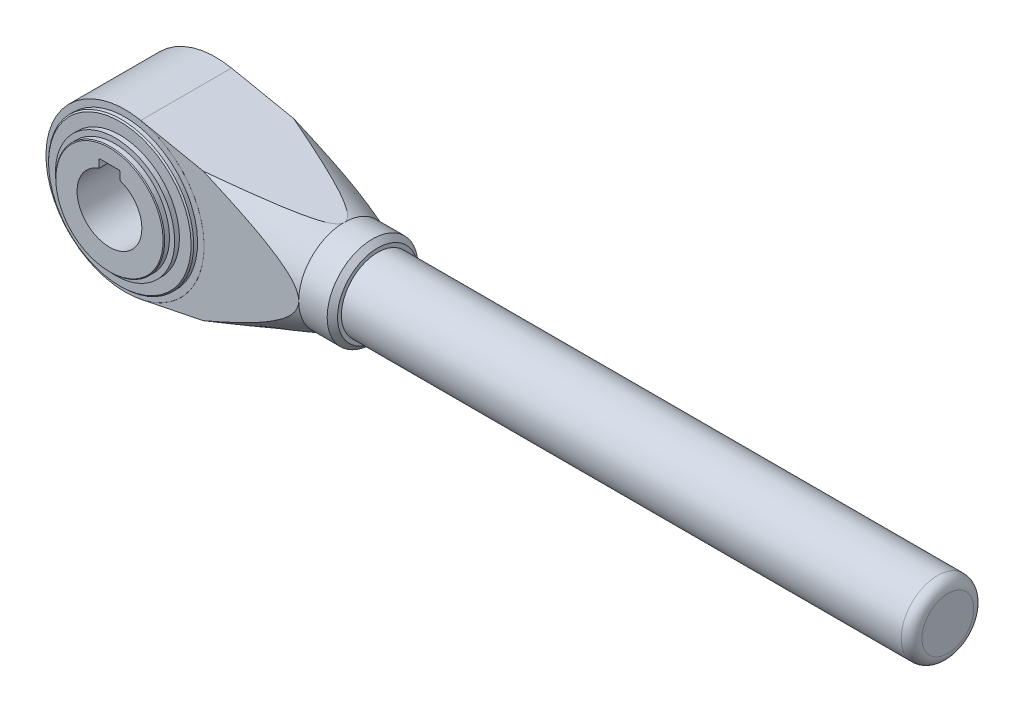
ISO-10303-21;
HEADER;
FILE_DESCRIPTION(('STEP AP214'),'2;1');
FILE_NAME('part.step','',(''),(''),'','','');
FILE_SCHEMA(('AUTOMOTIVE_DESIGN { 1 0 10303 214 1 1 1 1 }'));
ENDSEC;
DATA;
#1=APPLICATION_CONTEXT('core data for automotive mechanical design processes');
#2=APPLICATION_PROTOCOL_DEFINITION('international standard','automotive_design',2000,#1);
#3=PRODUCT_CONTEXT('',#1,'mechanical');
#4=PRODUCT('Part','Part','',(#3));
#5=PRODUCT_RELATED_PRODUCT_CATEGORY('part','',(#4));
#6=PRODUCT_DEFINITION_FORMATION('','',#4);
#7=PRODUCT_DEFINITION_CONTEXT('part definition',#1,'design');
#8=PRODUCT_DEFINITION('design','',#6,#7);
#9=PRODUCT_DEFINITION_SHAPE('','',#8);
#10=(LENGTH_UNIT() NAMED_UNIT(*) SI_UNIT(.MILLI.,.METRE.));
#11=(NAMED_UNIT(*) PLANE_ANGLE_UNIT() SI_UNIT($,.RADIAN.));
#12=(NAMED_UNIT(*) SI_UNIT($,.STERADIAN.) SOLID_ANGLE_UNIT());
#13=UNCERTAINTY_MEASURE_WITH_UNIT(LENGTH_MEASURE(1.E-05),#10,'distance_accuracy_value','');
#14=(GEOMETRIC_REPRESENTATION_CONTEXT(3) GLOBAL_UNCERTAINTY_ASSIGNED_CONTEXT((#13)) GLOBAL_UNIT_ASSIGNED_CONTEXT((#10,
#11,#12)) REPRESENTATION_CONTEXT('',''));
#15=CARTESIAN_POINT('',(0.,0.,0.));
#16=DIRECTION('',(0.,0.,1.));
#17=DIRECTION('',(1.,0.,0.));
#18=AXIS2_PLACEMENT_3D('',#15,#16,#17);
#19=CARTESIAN_POINT('',(0.,-1.11022302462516E-13,40.995238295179));
#20=DIRECTION('',(0.,0.,1.));
#21=DIRECTION('',(1.,0.,0.));
#22=AXIS2_PLACEMENT_3D('',#19,#20,#21);
#23=PLANE('',#22);
#24=CARTESIAN_POINT('',(-13.5439550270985,-42.4687426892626,40.995238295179));
#25=CARTESIAN_POINT('',(-11.7459572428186,-41.7822198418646,40.995238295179));
#26=CARTESIAN_POINT('',(-9.94874240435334,-41.0936397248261,40.995238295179));
#27=CARTESIAN_POINT('',(-6.35618468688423,-39.7115836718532,40.995238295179));
#28=CARTESIAN_POINT('',(-4.56084181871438,-39.0181077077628,40.995238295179));
#29=CARTESIAN_POINT('',(-0.972012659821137,-37.6253537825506,40.995238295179));
#30=CARTESIAN_POINT('',(0.821473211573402,-36.9260747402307,40.995238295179));
#31=CARTESIAN_POINT('',(4.40582162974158,-35.520831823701,40.995238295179));
#32=CARTESIAN_POINT('',(6.19668418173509,-34.8148679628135,40.995238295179));
#33=CARTESIAN_POINT('',(9.77638533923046,-33.3945384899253,40.995238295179));
#34=CARTESIAN_POINT('',(11.5652219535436,-32.680167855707,40.995238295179));
#35=CARTESIAN_POINT('',(15.1390338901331,-31.2418335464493,40.995238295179));
#36=CARTESIAN_POINT('',(16.9240092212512,-30.5178698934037,40.995238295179));
#37=CARTESIAN_POINT('',(20.4890065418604,-29.0582745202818,40.995238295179));
#38=CARTESIAN_POINT('',(22.269028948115,-28.322643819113,40.995238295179));
#39=CARTESIAN_POINT('',(25.8229819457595,-26.8368175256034,40.995238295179));
#40=CARTESIAN_POINT('',(27.5969125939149,-26.086622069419,40.995238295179));
#41=CARTESIAN_POINT('',(30.2514481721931,-24.9475868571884,40.995238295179));
#42=CARTESIAN_POINT('',(31.1350394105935,-24.5657037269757,40.995238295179));
#43=CARTESIAN_POINT('',(32.899915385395,-23.7966457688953,40.995238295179));
#44=CARTESIAN_POINT('',(33.7812001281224,-23.4094709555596,40.995238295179));
#45=CARTESIAN_POINT('',(35.5411699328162,-22.6290251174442,40.995238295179));
#46=CARTESIAN_POINT('',(36.4198547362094,-22.2357535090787,40.995238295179));
#47=CARTESIAN_POINT('',(38.1740583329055,-21.4422090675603,40.995238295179));
#48=CARTESIAN_POINT('',(39.0495771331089,-21.0419362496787,40.995238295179));
#49=CARTESIAN_POINT('',(40.7977972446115,-20.2327846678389,40.995238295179));
#50=CARTESIAN_POINT('',(41.6704944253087,-19.8238969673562,40.995238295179));
#51=CARTESIAN_POINT('',(43.4113049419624,-18.9964821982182,40.995238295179));
#52=CARTESIAN_POINT('',(44.279418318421,-18.5779552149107,40.995238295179));
#53=CARTESIAN_POINT('',(46.0098772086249,-17.7294637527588,40.995238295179));
#54=CARTESIAN_POINT('',(46.8722236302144,-17.2995011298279,40.995238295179));
#55=CARTESIAN_POINT('',(48.5898162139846,-16.4256627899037,40.995238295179));
#56=CARTESIAN_POINT('',(49.4450626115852,-15.9817875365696,40.995238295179));
#57=CARTESIAN_POINT('',(51.1487012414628,-15.0757163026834,40.995238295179));
#58=CARTESIAN_POINT('',(51.9970698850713,-14.6134757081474,40.995238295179));
#59=CARTESIAN_POINT('',(53.2605615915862,-13.903774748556,40.995238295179));
#60=CARTESIAN_POINT('',(53.6802621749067,-13.6644564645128,40.995238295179));
#61=CARTESIAN_POINT('',(54.5160824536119,-13.1796394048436,40.995238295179));
#62=CARTESIAN_POINT('',(54.9322021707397,-12.9341406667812,40.995238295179));
#63=CARTESIAN_POINT('',(55.7591898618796,-12.4367142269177,40.995238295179));
#64=CARTESIAN_POINT('',(56.1700682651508,-12.1848038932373,40.995238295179));
#65=CARTESIAN_POINT('',(56.9867762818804,-11.6729323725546,40.995238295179));
#66=CARTESIAN_POINT('',(57.3926060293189,-11.4129713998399,40.995238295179));
#67=CARTESIAN_POINT('',(58.1980066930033,-10.8838008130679,40.995238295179));
#68=CARTESIAN_POINT('',(58.5975797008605,-10.6145943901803,40.995238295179));
#69=CARTESIAN_POINT('',(59.3891424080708,-10.0652873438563,40.995238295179));
#70=CARTESIAN_POINT('',(59.7811328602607,-9.78518781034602,40.995238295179));
#71=CARTESIAN_POINT('',(60.4633898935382,-9.28030614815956,40.995238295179));
#72=CARTESIAN_POINT('',(60.755656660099,-9.05823012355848,40.995238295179));
#73=CARTESIAN_POINT('',(61.3334962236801,-8.60548866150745,40.995238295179));
#74=CARTESIAN_POINT('',(61.6190688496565,-8.37482300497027,40.995238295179));
#75=CARTESIAN_POINT('',(62.1828025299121,-7.90293250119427,40.995238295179));
#76=CARTESIAN_POINT('',(62.4609395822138,-7.66167886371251,40.995238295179));
#77=CARTESIAN_POINT('',(63.0068562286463,-7.16769588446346,40.995238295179));
#78=CARTESIAN_POINT('',(63.2746363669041,-6.9149671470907,40.995238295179));
#79=CARTESIAN_POINT('',(63.8001235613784,-6.39312799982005,40.995238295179));
#80=CARTESIAN_POINT('',(64.0576751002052,-6.12385987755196,40.995238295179));
#81=CARTESIAN_POINT('',(64.5554015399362,-5.56938384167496,40.995238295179));
#82=CARTESIAN_POINT('',(64.7955693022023,-5.28416946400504,40.995238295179));
#83=CARTESIAN_POINT('',(65.2518593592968,-4.69673422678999,40.995238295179));
#84=CARTESIAN_POINT('',(65.4680749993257,-4.39458683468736,40.995238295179));
#85=CARTESIAN_POINT('',(65.8695967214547,-3.77069273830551,40.995238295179));
#86=CARTESIAN_POINT('',(66.0549404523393,-3.44897056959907,40.995238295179));
#87=CARTESIAN_POINT('',(66.3904891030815,-2.77325340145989,40.995238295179));
#88=CARTESIAN_POINT('',(66.5392839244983,-2.41853279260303,40.995238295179));
#89=CARTESIAN_POINT('',(66.7196263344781,-1.87261323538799,40.995238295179));
#90=CARTESIAN_POINT('',(66.7725900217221,-1.68838697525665,40.995238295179));
#91=CARTESIAN_POINT('',(66.8627656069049,-1.31615236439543,40.995238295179));
#92=CARTESIAN_POINT('',(66.8999849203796,-1.1281458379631,40.995238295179));
#93=CARTESIAN_POINT('',(66.9576905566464,-0.747885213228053,40.995238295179));
#94=CARTESIAN_POINT('',(66.9780281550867,-0.555608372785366,40.995238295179));
#95=CARTESIAN_POINT('',(67.0006678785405,-0.169992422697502,40.995238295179));
#96=CARTESIAN_POINT('',(67.0029707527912,0.0233466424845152,40.995238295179));
#97=CARTESIAN_POINT('',(66.9894474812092,0.409503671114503,40.995238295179));
#98=CARTESIAN_POINT('',(66.9736101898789,0.602321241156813,40.995238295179));
#99=CARTESIAN_POINT('',(66.9243899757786,0.985697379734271,40.995238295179));
#100=CARTESIAN_POINT('',(66.891005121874,1.17625569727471,40.995238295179));
#101=CARTESIAN_POINT('',(66.8023201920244,1.57883927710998,40.995238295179));
#102=CARTESIAN_POINT('',(66.7446971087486,1.79035148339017,40.995238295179));
#103=CARTESIAN_POINT('',(66.6106352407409,2.2074106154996,40.995238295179));
#104=CARTESIAN_POINT('',(66.5341836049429,2.41295335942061,40.995238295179));
#105=CARTESIAN_POINT('',(66.3648693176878,2.81738401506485,40.995238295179));
#106=CARTESIAN_POINT('',(66.2719881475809,3.01626411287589,40.995238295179));
#107=CARTESIAN_POINT('',(66.0723025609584,3.40679383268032,40.995238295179));
#108=CARTESIAN_POINT('',(65.9655005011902,3.59844467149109,40.995238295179));
#109=CARTESIAN_POINT('',(65.6571666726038,4.11315243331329,40.995238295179));
#110=CARTESIAN_POINT('',(65.4437664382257,4.42911171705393,40.995238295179));
#111=CARTESIAN_POINT('',(64.9906350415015,5.04155035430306,40.995238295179));
#112=CARTESIAN_POINT('',(64.7508815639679,5.33801285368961,40.995238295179));
#113=CARTESIAN_POINT('',(64.2508405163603,5.91477331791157,40.995238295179));
#114=CARTESIAN_POINT('',(63.9904845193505,6.1950115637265,40.995238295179));
#115=CARTESIAN_POINT('',(63.588735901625,6.60409871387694,40.995238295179));
#116=CARTESIAN_POINT('',(63.4529742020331,6.73856121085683,40.995238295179));
#117=CARTESIAN_POINT('',(63.1781178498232,7.00404132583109,40.995238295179));
#118=CARTESIAN_POINT('',(63.0390231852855,7.135058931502,40.995238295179));
#119=CARTESIAN_POINT('',(62.6480726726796,7.49503555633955,40.995238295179));
#120=CARTESIAN_POINT('',(62.3930281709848,7.72053493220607,40.995238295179));
#121=CARTESIAN_POINT('',(61.8753869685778,8.1627236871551,40.995238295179));
#122=CARTESIAN_POINT('',(61.6127891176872,8.37941171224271,40.995238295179));
#123=CARTESIAN_POINT('',(61.0812625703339,8.80515294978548,40.995238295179));
#124=CARTESIAN_POINT('',(60.8123306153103,9.0142020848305,40.995238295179));
#125=CARTESIAN_POINT('',(60.2692856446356,9.42547185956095,40.995238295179));
#126=CARTESIAN_POINT('',(59.9951722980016,9.62769206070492,40.995238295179));
#127=CARTESIAN_POINT('',(59.1650692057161,10.226214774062,40.995238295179));
#128=CARTESIAN_POINT('',(58.6025193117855,10.6134296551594,40.995238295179));
#129=CARTESIAN_POINT('',(57.4648971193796,11.3684817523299,40.995238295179));
#130=CARTESIAN_POINT('',(56.8898282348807,11.7363241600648,40.995238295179));
#131=CARTESIAN_POINT('',(55.7241465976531,12.4600235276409,40.995238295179));
#132=CARTESIAN_POINT('',(55.1334354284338,12.8157214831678,40.995238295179));
#133=CARTESIAN_POINT('',(53.9442921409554,13.5139991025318,40.995238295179));
#134=CARTESIAN_POINT('',(53.345859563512,13.8565779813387,40.995238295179));
#135=CARTESIAN_POINT('',(52.1437647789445,14.530239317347,40.995238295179));
#136=CARTESIAN_POINT('',(51.5401118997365,14.861338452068,40.995238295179));
#137=CARTESIAN_POINT('',(50.6309039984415,15.3510148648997,40.995238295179));
#138=CARTESIAN_POINT('',(50.3272173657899,15.513076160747,40.995238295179));
#139=CARTESIAN_POINT('',(49.7187057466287,15.835048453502,40.995238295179));
#140=CARTESIAN_POINT('',(49.4138807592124,15.9949594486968,40.995238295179));
#141=CARTESIAN_POINT('',(48.4843027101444,16.4787630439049,40.995238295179));
#142=CARTESIAN_POINT('',(47.8579034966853,16.7994957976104,40.995238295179));
#143=CARTESIAN_POINT('',(46.6014865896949,17.4338041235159,40.995238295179));
#144=CARTESIAN_POINT('',(45.9714688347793,17.7473795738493,40.995238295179));
#145=CARTESIAN_POINT('',(44.7083359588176,18.3683168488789,40.995238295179));
#146=CARTESIAN_POINT('',(44.0752206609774,18.6756783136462,40.995238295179));
#147=CARTESIAN_POINT('',(42.8063622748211,19.2849325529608,40.995238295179));
#148=CARTESIAN_POINT('',(42.1706191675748,19.5868252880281,40.995238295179));
#149=CARTESIAN_POINT('',(40.2596759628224,20.4854368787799,40.995238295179));
#150=CARTESIAN_POINT('',(38.9810779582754,21.0749346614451,40.995238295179));
#151=CARTESIAN_POINT('',(36.4170153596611,22.2386451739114,40.995238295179));
#152=CARTESIAN_POINT('',(35.131550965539,22.812858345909,40.995238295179));
#153=CARTESIAN_POINT('',(32.5529115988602,23.9498900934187,40.995238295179));
#154=CARTESIAN_POINT('',(31.2597270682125,24.5126869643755,40.995238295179));
#155=CARTESIAN_POINT('',(28.6689462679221,25.6280399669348,40.995238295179));
#156=CARTESIAN_POINT('',(27.3713499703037,26.1805960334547,40.995238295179));
#157=CARTESIAN_POINT('',(24.7727390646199,27.2770635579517,40.995238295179));
#158=CARTESIAN_POINT('',(23.4717249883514,27.8209762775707,40.995238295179));
#159=CARTESIAN_POINT('',(20.8666981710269,28.9015578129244,40.995238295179));
#160=CARTESIAN_POINT('',(19.5626854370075,29.4382266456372,40.995238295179));
#161=CARTESIAN_POINT('',(17.056596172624,30.462669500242,40.995238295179));
#162=CARTESIAN_POINT('',(15.8547139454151,30.9509192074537,40.995238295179));
#163=CARTESIAN_POINT('',(13.4490994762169,31.9228413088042,40.995238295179));
#164=CARTESIAN_POINT('',(12.245367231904,32.4065136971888,40.995238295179));
#165=CARTESIAN_POINT('',(8.63166623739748,33.8515633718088,40.995238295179));
#166=CARTESIAN_POINT('',(6.21929417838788,34.8069320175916,40.995238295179));
#167=CARTESIAN_POINT('',(1.3968911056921,36.7022485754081,40.995238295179));
#168=CARTESIAN_POINT('',(-1.0131250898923,37.6422342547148,40.995238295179));
#169=CARTESIAN_POINT('',(-4.63099382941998,39.0446494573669,40.995238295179));
#170=CARTESIAN_POINT('',(-5.83738773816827,39.5108466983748,40.995238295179));
#171=CARTESIAN_POINT('',(-8.2510508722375,40.44096512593,40.995238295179));
#172=CARTESIAN_POINT('',(-9.45832009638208,40.9048863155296,40.995238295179));
#173=CARTESIAN_POINT('',(-10.665980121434,41.3677877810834,40.995238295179));
#174=B_SPLINE_CURVE_WITH_KNOTS('',3,(#24,#25,#26,#27,#28,#29,#30,#31,#32,#33,#34,#35,#36,#37,
#38,#39,#40,#41,#42,#43,#44,#45,#46,#47,#48,#49,#50,#51,#52,#53,#54,#55,#56,#57,#58,#59,#60,#61,
#62,#63,#64,#65,#66,#67,#68,#69,#70,#71,#72,#73,#74,#75,#76,#77,#78,#79,#80,#81,#82,#83,#84,#85,
#86,#87,#88,#89,#90,#91,#92,#93,#94,#95,#96,#97,#98,#99,#100,#101,#102,#103,#104,#105,#106,#107,
#108,#109,#110,#111,#112,#113,#114,#115,#116,#117,#118,#119,#120,#121,#122,#123,#124,#125,#126,
#127,#128,#129,#130,#131,#132,#133,#134,#135,#136,#137,#138,#139,#140,#141,#142,#143,#144,#145,
#146,#147,#148,#149,#150,#151,#152,#153,#154,#155,#156,#157,#158,#159,#160,#161,#162,#163,#164,
#165,#166,#167,#168,#169,#170,#171,#172,#173),.UNSPECIFIED.,.F.,.F.,(4,2,2,2,2,2,2,2,2,2,2,2,2,
2,2,2,2,2,2,2,2,2,2,2,2,2,2,2,2,2,2,2,2,2,2,2,2,2,2,2,2,2,2,2,2,2,2,2,2,2,2,2,2,2,2,2,2,2,2,2,2,
2,2,2,2,2,2,2,2,2,2,2,2,2,4),(0.,5.77382141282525,11.54767605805,17.322631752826,
23.0975759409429,28.876165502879,34.6547418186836,40.4328162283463,46.2108366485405,
49.0985752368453,51.9863058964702,54.8743146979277,57.762317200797,60.6534794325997,
63.5446160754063,66.4352863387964,69.3258603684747,72.2239464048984,73.6733168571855,
75.1226785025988,76.5684619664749,78.0142069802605,79.4594578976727,80.904564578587,
82.0056305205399,83.106724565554,84.2110247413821,85.3152668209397,86.4324964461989,
87.5501822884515,88.6633465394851,89.7751431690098,90.9247669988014,91.4992582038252,
92.0734785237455,92.6527054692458,93.2319083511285,93.8114672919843,94.3910900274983,
95.0477504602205,95.7048603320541,96.3627156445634,97.0204597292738,98.1622861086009,
99.3050869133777,100.451856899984,101.025050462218,101.598246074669,102.619302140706,
103.640514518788,104.662264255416,105.684079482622,107.732303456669,109.779975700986,
111.848374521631,113.916896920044,115.982276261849,117.014938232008,118.047601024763,
120.158751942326,122.269938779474,124.381247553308,126.492571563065,130.716274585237,
134.939855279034,139.170828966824,143.401829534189,147.632206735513,151.862574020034,
155.754372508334,159.646175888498,167.430109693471,175.190608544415,179.070624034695,
182.950634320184),.UNSPECIFIED.);
#175=CARTESIAN_POINT('',(30.1371893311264,24.9959124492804,40.995238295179));
#176=VERTEX_POINT('',#175);
#177=CARTESIAN_POINT('',(67.,-1.11022302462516E-13,40.995238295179));
#178=VERTEX_POINT('',#177);
#179=EDGE_CURVE('E225',#176,#178,#174,.F.);
#180=ORIENTED_EDGE('',*,*,#179,.F.);
#181=DIRECTION('',(-0.979945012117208,0.199268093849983,0.));
#182=VECTOR('',#181,1.);
#183=CARTESIAN_POINT('',(67.,17.5000000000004,40.995238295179));
#184=LINE('',#183,#182);
#185=CARTESIAN_POINT('',(6.0776768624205,29.8883228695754,40.995238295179));
#186=VERTEX_POINT('',#185);
#187=EDGE_CURVE('E378',#176,#186,#184,.T.);
#188=ORIENTED_EDGE('',*,*,#187,.T.);
#189=CARTESIAN_POINT('',(0.,-1.11022302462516E-13,40.995238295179));
#190=DIRECTION('',(0.,0.,1.));
#191=DIRECTION('',(1.,0.,0.));
#192=AXIS2_PLACEMENT_3D('',#189,#190,#191);
#193=CIRCLE('',#192,30.5);
#194=CARTESIAN_POINT('',(6.0776768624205,-29.8883228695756,40.995238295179));
#195=VERTEX_POINT('',#194);
#196=EDGE_CURVE('E417',#186,#195,#193,.F.);
#197=ORIENTED_EDGE('',*,*,#196,.T.);
#198=DIRECTION('',(-0.979945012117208,-0.199268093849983,0.));
#199=VECTOR('',#198,1.);
#200=CARTESIAN_POINT('',(67.,-17.5,40.995238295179));
#201=LINE('',#200,#199);
#202=CARTESIAN_POINT('',(30.1371893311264,-24.9959124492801,40.995238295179));
#203=VERTEX_POINT('',#202);
#204=EDGE_CURVE('E381',#203,#195,#201,.T.);
#205=ORIENTED_EDGE('',*,*,#204,.F.);
#206=EDGE_CURVE('E218',#178,#203,#174,.F.);
#207=ORIENTED_EDGE('',*,*,#206,.F.);
#208=EDGE_LOOP('',(#180,#188,#197,#205,#207));
#209=FACE_BOUND('',#208,.T.);
#210=ADVANCED_FACE('F15',(#209),#23,.T.);
#211=CARTESIAN_POINT('',(67.,17.5000000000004,40.995238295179));
#212=DIRECTION('',(-0.199268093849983,-0.979945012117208,0.));
#213=DIRECTION('',(0.979945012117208,-0.199268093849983,0.));
#214=AXIS2_PLACEMENT_3D('',#211,#212,#213);
#215=PLANE('',#214);
#216=ORIENTED_EDGE('',*,*,#187,.F.);
#217=CARTESIAN_POINT('',(30.1365740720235,24.9960375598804,40.995438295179));
#218=CARTESIAN_POINT('',(31.026481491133,24.8150782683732,40.7061386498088));
#219=CARTESIAN_POINT('',(31.91597137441,24.6342038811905,40.4154947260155));
#220=CARTESIAN_POINT('',(33.6939456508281,24.2726595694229,39.8309899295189));
#221=CARTESIAN_POINT('',(34.5824300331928,24.0919896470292,39.5371290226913));
#222=CARTESIAN_POINT('',(36.3586053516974,23.730811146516,38.9455343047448));
#223=CARTESIAN_POINT('',(37.2462957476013,23.5503026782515,38.6477988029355));
#224=CARTESIAN_POINT('',(39.0202331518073,23.1895792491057,38.0478910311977));
#225=CARTESIAN_POINT('',(39.906480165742,23.0093642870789,37.7457187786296));
#226=CARTESIAN_POINT('',(41.6787292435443,22.6489841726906,37.1355364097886));
#227=CARTESIAN_POINT('',(42.5647283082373,22.4688196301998,36.8275172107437));
#228=CARTESIAN_POINT('',(44.334532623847,22.1089366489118,36.2049873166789));
#229=CARTESIAN_POINT('',(45.2183378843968,21.9292182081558,35.8904766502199));
#230=CARTESIAN_POINT('',(46.9829510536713,21.5703908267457,35.2534967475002));
#231=CARTESIAN_POINT('',(47.8637596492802,21.3912817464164,34.931029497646));
#232=CARTESIAN_POINT('',(49.6217289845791,21.0338053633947,34.2759355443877));
#233=CARTESIAN_POINT('',(50.498889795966,20.8554380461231,33.9433090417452));
#234=CARTESIAN_POINT('',(52.2477381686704,20.4998163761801,33.265106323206));
#235=CARTESIAN_POINT('',(53.1194290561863,20.3225613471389,32.9195390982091));
#236=CARTESIAN_POINT('',(54.4219120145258,20.0577063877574,32.3877899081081));
#237=CARTESIAN_POINT('',(54.8553162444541,19.969575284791,32.2082701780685));
#238=CARTESIAN_POINT('',(55.7199860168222,19.7937479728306,31.8439521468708));
#239=CARTESIAN_POINT('',(56.151251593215,19.7060517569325,31.6591539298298));
#240=CARTESIAN_POINT('',(57.0123892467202,19.5309426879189,31.2827051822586));
#241=CARTESIAN_POINT('',(57.442253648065,19.4435313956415,31.0910363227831));
#242=CARTESIAN_POINT('',(58.2985926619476,19.2693981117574,30.6999886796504));
#243=CARTESIAN_POINT('',(58.7250674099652,19.1826760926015,30.5006102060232));
#244=CARTESIAN_POINT('',(59.5733205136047,19.0101870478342,30.0924174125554));
#245=CARTESIAN_POINT('',(59.9951018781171,18.9244194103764,29.8836096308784));
#246=CARTESIAN_POINT('',(60.8326640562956,18.7541043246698,29.453876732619));
#247=CARTESIAN_POINT('',(61.2484457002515,18.6695567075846,29.2329533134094));
#248=CARTESIAN_POINT('',(62.0052812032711,18.515657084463,28.8120254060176));
#249=CARTESIAN_POINT('',(62.3475870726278,18.4460504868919,28.6143809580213));
#250=CARTESIAN_POINT('',(63.0240984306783,18.3084844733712,28.204372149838));
#251=CARTESIAN_POINT('',(63.3582962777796,18.2405266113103,27.99199457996));
#252=CARTESIAN_POINT('',(64.0127688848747,18.1074420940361,27.5488096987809));
#253=CARTESIAN_POINT('',(64.3331019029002,18.0423035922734,27.3180940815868));
#254=CARTESIAN_POINT('',(64.798236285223,17.9477202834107,26.9521033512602));
#255=CARTESIAN_POINT('',(64.9506184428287,17.9167339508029,26.8268819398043));
#256=CARTESIAN_POINT('',(65.2486625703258,17.8561278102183,26.5684109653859));
#257=CARTESIAN_POINT('',(65.394327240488,17.8265074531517,26.4351646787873));
#258=CARTESIAN_POINT('',(65.6319573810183,17.7781862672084,26.2026738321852));
#259=CARTESIAN_POINT('',(65.7263312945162,17.7589956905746,26.1060098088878));
#260=CARTESIAN_POINT('',(65.9097382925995,17.7217005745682,25.907553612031));
#261=CARTESIAN_POINT('',(65.9987700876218,17.7035962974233,25.8057602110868));
#262=CARTESIAN_POINT('',(66.2555429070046,17.6513825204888,25.4920533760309));
#263=CARTESIAN_POINT('',(66.4135434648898,17.6192537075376,25.2712663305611));
#264=CARTESIAN_POINT('',(66.634463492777,17.5743304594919,24.8904608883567));
#265=CARTESIAN_POINT('',(66.7108303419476,17.5588015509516,24.7386539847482));
#266=CARTESIAN_POINT('',(66.8400455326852,17.5325261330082,24.424865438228));
#267=CARTESIAN_POINT('',(66.8929261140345,17.5217730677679,24.2628980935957));
#268=CARTESIAN_POINT('',(66.9693239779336,17.5062378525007,23.9295515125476));
#269=CARTESIAN_POINT('',(66.9924777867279,17.5015296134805,23.7580820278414));
#270=CARTESIAN_POINT('',(67.0043774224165,17.4991098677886,23.4139098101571));
#271=CARTESIAN_POINT('',(66.9931400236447,17.5013949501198,23.2412077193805));
#272=CARTESIAN_POINT('',(66.9422838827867,17.5117363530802,22.9262008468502));
#273=CARTESIAN_POINT('',(66.90701810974,17.518907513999,22.7831203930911));
#274=CARTESIAN_POINT('',(66.8165649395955,17.5373008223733,22.5037460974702));
#275=CARTESIAN_POINT('',(66.7613648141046,17.548525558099,22.3674566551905));
#276=CARTESIAN_POINT('',(66.588923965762,17.5835907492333,22.005510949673));
#277=CARTESIAN_POINT('',(66.4559000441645,17.6106406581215,21.787774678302));
#278=CARTESIAN_POINT('',(66.1603141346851,17.6707469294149,21.3742692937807));
#279=CARTESIAN_POINT('',(65.9976441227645,17.7038252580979,21.1785848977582));
#280=CARTESIAN_POINT('',(65.701347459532,17.7640760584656,20.8570619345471));
#281=CARTESIAN_POINT('',(65.5721472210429,17.7903484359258,20.7268843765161));
#282=CARTESIAN_POINT('',(65.3064246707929,17.8443821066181,20.4745132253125));
#283=CARTESIAN_POINT('',(65.1698997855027,17.8721439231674,20.3523224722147));
#284=CARTESIAN_POINT('',(64.7516310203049,17.9571972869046,19.995362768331));
#285=CARTESIAN_POINT('',(64.461652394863,18.0161633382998,19.7706797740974));
#286=CARTESIAN_POINT('',(63.8665513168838,18.1371748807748,19.3394330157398));
#287=CARTESIAN_POINT('',(63.561343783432,18.199237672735,19.1329944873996));
#288=CARTESIAN_POINT('',(63.0969289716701,18.2936746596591,18.8345637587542));
#289=CARTESIAN_POINT('',(62.9411151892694,18.3253588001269,18.7370110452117));
#290=CARTESIAN_POINT('',(62.6275809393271,18.3891147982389,18.5451624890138));
#291=CARTESIAN_POINT('',(62.4698605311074,18.4211866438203,18.4508665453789));
#292=CARTESIAN_POINT('',(61.9556348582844,18.5257524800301,18.1496000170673));
#293=CARTESIAN_POINT('',(61.5958951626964,18.5989041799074,17.9483733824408));
#294=CARTESIAN_POINT('',(60.8706659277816,18.7463767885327,17.5569723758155));
#295=CARTESIAN_POINT('',(60.5051754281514,18.8206978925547,17.3667998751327));
#296=CARTESIAN_POINT('',(59.7697339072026,18.9702471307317,16.9951784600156));
#297=CARTESIAN_POINT('',(59.3997806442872,19.0454757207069,16.8137341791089));
#298=CARTESIAN_POINT('',(58.6565637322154,19.1966060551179,16.4580326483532));
#299=CARTESIAN_POINT('',(58.2832999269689,19.272507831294,16.2837757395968));
#300=CARTESIAN_POINT('',(57.1579637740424,19.5013406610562,15.7691133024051));
#301=CARTESIAN_POINT('',(56.4019771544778,19.6550676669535,15.4376244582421));
#302=CARTESIAN_POINT('',(54.883380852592,19.9638684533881,14.7917016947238));
#303=CARTESIAN_POINT('',(54.1207732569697,20.1189418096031,14.4772626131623));
#304=CARTESIAN_POINT('',(52.5914369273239,20.4299265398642,13.861450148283));
#305=CARTESIAN_POINT('',(51.8247132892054,20.5858368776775,13.5600635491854));
#306=CARTESIAN_POINT('',(50.2875700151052,20.8984091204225,12.9671283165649));
#307=CARTESIAN_POINT('',(49.5171501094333,21.0550710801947,12.6755804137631));
#308=CARTESIAN_POINT('',(47.9744299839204,21.3687773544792,12.1006777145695));
#309=CARTESIAN_POINT('',(47.2021331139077,21.5258209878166,11.8173135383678));
#310=CARTESIAN_POINT('',(45.6553232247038,21.8403589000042,11.2569503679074));
#311=CARTESIAN_POINT('',(44.8808101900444,21.997853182,10.9799514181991));
#312=CARTESIAN_POINT('',(42.9451413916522,22.3914640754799,10.2950150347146));
#313=CARTESIAN_POINT('',(41.7828821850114,22.6278050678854,9.89032680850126));
#314=CARTESIAN_POINT('',(39.4549921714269,23.1011726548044,9.08985941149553));
#315=CARTESIAN_POINT('',(38.2893603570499,23.3381994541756,8.69408330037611));
#316=CARTESIAN_POINT('',(35.9600193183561,23.811862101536,7.9111034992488));
#317=CARTESIAN_POINT('',(34.7963184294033,24.0484962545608,7.5238739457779));
#318=CARTESIAN_POINT('',(32.467501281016,24.5220523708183,6.7553594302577));
#319=CARTESIAN_POINT('',(31.3023856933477,24.7589741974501,6.37407234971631));
#320=CARTESIAN_POINT('',(30.136574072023,24.9960375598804,5.995038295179));
#321=B_SPLINE_CURVE_WITH_KNOTS('',3,(#217,#218,#219,#220,#221,#222,#223,#224,#225,#226,#227,
#228,#229,#230,#231,#232,#233,#234,#235,#236,#237,#238,#239,#240,#241,#242,#243,#244,#245,#246,
#247,#248,#249,#250,#251,#252,#253,#254,#255,#256,#257,#258,#259,#260,#261,#262,#263,#264,#265,
#266,#267,#268,#269,#270,#271,#272,#273,#274,#275,#276,#277,#278,#279,#280,#281,#282,#283,#284,
#285,#286,#287,#288,#289,#290,#291,#292,#293,#294,#295,#296,#297,#298,#299,#300,#301,#302,#303,
#304,#305,#306,#307,#308,#309,#310,#311,#312,#313,#314,#315,#316,#317,#318,#319,#320),
.UNSPECIFIED.,.F.,.F.,(4,2,2,2,2,2,2,2,2,2,2,2,2,2,2,2,2,2,2,2,2,2,2,2,2,2,2,2,2,2,2,2,2,2,2,2,
2,2,2,2,2,2,2,2,2,2,2,2,2,2,2,4),(0.,2.85926450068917,5.71855936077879,8.57914676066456,
11.4397229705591,14.3051810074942,17.170626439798,20.0353635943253,22.900044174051,
25.7627700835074,27.1947012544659,28.6266096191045,30.0626733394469,31.4986793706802,
32.9337045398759,34.3685291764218,35.5723061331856,36.7771767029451,37.9763617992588,
38.575112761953,39.1736209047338,39.5827665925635,39.9920106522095,40.8080883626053,
41.3185144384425,41.8282376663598,42.3441357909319,42.8597823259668,43.3006371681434,
43.7417740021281,44.5070575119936,45.2751874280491,45.8306722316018,46.3863535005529,
47.4997052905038,48.620186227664,49.1797817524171,49.7393599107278,50.9949837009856,
52.2508194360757,53.5073146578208,54.7638694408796,57.2825257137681,59.8004150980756,
62.3156924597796,64.8311562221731,67.3436121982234,69.8560857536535,73.6155931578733,
77.376372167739,81.1235254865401,84.8693108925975),.UNSPECIFIED.);
#322=CARTESIAN_POINT('',(67.,17.5000000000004,23.495238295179));
#323=VERTEX_POINT('',#322);
#324=EDGE_CURVE('E226',#176,#323,#321,.T.);
#325=ORIENTED_EDGE('',*,*,#324,.T.);
#326=CARTESIAN_POINT('',(30.1371893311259,24.9959124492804,5.995238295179));
#327=VERTEX_POINT('',#326);
#328=EDGE_CURVE('E191',#323,#327,#321,.T.);
#329=ORIENTED_EDGE('',*,*,#328,.T.);
#330=DIRECTION('',(-0.979945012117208,0.199268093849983,0.));
#331=VECTOR('',#330,1.);
#332=CARTESIAN_POINT('',(67.,17.5000000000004,5.995238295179));
#333=LINE('',#332,#331);
#334=CARTESIAN_POINT('',(6.0776768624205,29.8883228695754,5.995238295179));
#335=VERTEX_POINT('',#334);
#336=EDGE_CURVE('E368',#327,#335,#333,.T.);
#337=ORIENTED_EDGE('',*,*,#336,.T.);
#338=DIRECTION('',(0.,0.,-1.));
#339=VECTOR('',#338,1.);
#340=CARTESIAN_POINT('',(6.0776768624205,29.8883228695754,40.995238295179));
#341=LINE('',#340,#339);
#342=EDGE_CURVE('E388',#186,#335,#341,.T.);
#343=ORIENTED_EDGE('',*,*,#342,.F.);
#344=EDGE_LOOP('',(#216,#325,#329,#337,#343));
#345=FACE_BOUND('',#344,.T.);
#346=ADVANCED_FACE('F231',(#345),#215,.F.);
#347=CARTESIAN_POINT('',(0.,-1.11022302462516E-13,40.995238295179));
#348=DIRECTION('',(0.,0.,-1.));
#349=DIRECTION('',(-1.,0.,0.));
#350=AXIS2_PLACEMENT_3D('',#347,#348,#349);
#351=CYLINDRICAL_SURFACE('',#350,30.5);
#352=ORIENTED_EDGE('',*,*,#342,.T.);
#353=CARTESIAN_POINT('',(0.,-1.11022302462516E-13,5.995238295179));
#354=DIRECTION('',(0.,0.,1.));
#355=DIRECTION('',(1.,0.,0.));
#356=AXIS2_PLACEMENT_3D('',#353,#354,#355);
#357=CIRCLE('',#356,30.5);
#358=CARTESIAN_POINT('',(6.0776768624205,-29.8883228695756,5.995238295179));
#359=VERTEX_POINT('',#358);
#360=EDGE_CURVE('E371',#335,#359,#357,.T.);
#361=ORIENTED_EDGE('',*,*,#360,.T.);
#362=DIRECTION('',(0.,0.,-1.));
#363=VECTOR('',#362,1.);
#364=CARTESIAN_POINT('',(6.0776768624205,-29.8883228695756,40.995238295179));
#365=LINE('',#364,#363);
#366=EDGE_CURVE('E384',#195,#359,#365,.T.);
#367=ORIENTED_EDGE('',*,*,#366,.F.);
#368=ORIENTED_EDGE('',*,*,#196,.F.);
#369=EDGE_LOOP('',(#352,#361,#367,#368));
#370=FACE_BOUND('',#369,.T.);
#371=CARTESIAN_POINT('',(0.,-1.11022302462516E-13,41.));
#372=DIRECTION('',(0.,0.,1.));
#373=DIRECTION('',(0.,-1.,0.));
#374=AXIS2_PLACEMENT_3D('',#371,#372,#373);
#375=CIRCLE('',#374,30.5);
#376=CARTESIAN_POINT('',(0.,-30.5000000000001,40.9999999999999));
#377=VERTEX_POINT('',#376);
#378=EDGE_CURVE('E335',#377,#377,#375,.T.);
#379=ORIENTED_EDGE('',*,*,#378,.F.);
#380=EDGE_LOOP('',(#379));
#381=FACE_BOUND('',#380,.T.);
#382=ADVANCED_FACE('F438',(#370,#381),#351,.T.);
#383=CARTESIAN_POINT('',(67.,-17.5,40.995238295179));
#384=DIRECTION('',(0.199268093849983,-0.979945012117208,0.));
#385=DIRECTION('',(0.979945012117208,0.199268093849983,0.));
#386=AXIS2_PLACEMENT_3D('',#383,#384,#385);
#387=PLANE('',#386);
#388=CARTESIAN_POINT('',(30.1365740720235,-24.99603755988,40.995438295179));
#389=CARTESIAN_POINT('',(31.0264814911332,-24.8150782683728,40.7061386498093));
#390=CARTESIAN_POINT('',(31.9159713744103,-24.6342038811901,40.4154947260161));
#391=CARTESIAN_POINT('',(33.6939456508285,-24.2726595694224,39.8309899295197));
#392=CARTESIAN_POINT('',(34.5824300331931,-24.0919896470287,39.537129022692));
#393=CARTESIAN_POINT('',(36.3586053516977,-23.7308111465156,38.9455343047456));
#394=CARTESIAN_POINT('',(37.2462957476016,-23.5503026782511,38.6477988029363));
#395=CARTESIAN_POINT('',(39.0202331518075,-23.1895792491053,38.0478910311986));
#396=CARTESIAN_POINT('',(39.9064801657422,-23.0093642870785,37.7457187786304));
#397=CARTESIAN_POINT('',(41.6787292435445,-22.6489841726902,37.1355364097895));
#398=CARTESIAN_POINT('',(42.5647283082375,-22.4688196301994,36.8275172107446));
#399=CARTESIAN_POINT('',(44.3345326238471,-22.1089366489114,36.2049873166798));
#400=CARTESIAN_POINT('',(45.2183378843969,-21.9292182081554,35.8904766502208));
#401=CARTESIAN_POINT('',(46.9829510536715,-21.5703908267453,35.2534967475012));
#402=CARTESIAN_POINT('',(47.8637596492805,-21.3912817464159,34.9310294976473));
#403=CARTESIAN_POINT('',(49.6217289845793,-21.0338053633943,34.2759355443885));
#404=CARTESIAN_POINT('',(50.4988897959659,-20.8554380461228,33.9433090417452));
#405=CARTESIAN_POINT('',(52.2477381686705,-20.4998163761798,33.265106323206));
#406=CARTESIAN_POINT('',(53.1194290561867,-20.3225613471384,32.91953909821));
#407=CARTESIAN_POINT('',(54.4219120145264,-20.0577063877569,32.3877899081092));
#408=CARTESIAN_POINT('',(54.8553162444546,-19.9695752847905,32.2082701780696));
#409=CARTESIAN_POINT('',(55.7199860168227,-19.7937479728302,31.8439521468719));
#410=CARTESIAN_POINT('',(56.1512515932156,-19.7060517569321,31.659153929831));
#411=CARTESIAN_POINT('',(57.0123892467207,-19.5309426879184,31.2827051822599));
#412=CARTESIAN_POINT('',(57.4422536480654,-19.443531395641,31.0910363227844));
#413=CARTESIAN_POINT('',(58.2985926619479,-19.269398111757,30.6999886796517));
#414=CARTESIAN_POINT('',(58.7250674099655,-19.1826760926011,30.5006102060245));
#415=CARTESIAN_POINT('',(59.5733205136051,-19.0101870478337,30.092417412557));
#416=CARTESIAN_POINT('',(59.9951018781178,-18.9244194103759,29.8836096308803));
#417=CARTESIAN_POINT('',(60.8326640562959,-18.7541043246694,29.45387673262));
#418=CARTESIAN_POINT('',(61.2484457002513,-18.6695567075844,29.2329533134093));
#419=CARTESIAN_POINT('',(62.0052812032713,-18.5156570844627,28.8120254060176));
#420=CARTESIAN_POINT('',(62.3475870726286,-18.4460504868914,28.6143809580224));
#421=CARTESIAN_POINT('',(63.0240984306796,-18.3084844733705,28.2043721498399));
#422=CARTESIAN_POINT('',(63.3582962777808,-18.2405266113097,27.9919945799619));
#423=CARTESIAN_POINT('',(64.0127688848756,-18.1074420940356,27.5488096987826));
#424=CARTESIAN_POINT('',(64.3331019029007,-18.042303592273,27.3180940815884));
#425=CARTESIAN_POINT('',(64.7982362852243,-17.9477202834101,26.9521033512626));
#426=CARTESIAN_POINT('',(64.9506184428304,-17.9167339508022,26.8268819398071));
#427=CARTESIAN_POINT('',(65.2486625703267,-17.8561278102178,26.5684109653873));
#428=CARTESIAN_POINT('',(65.3943272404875,-17.8265074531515,26.4351646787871));
#429=CARTESIAN_POINT('',(65.6319573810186,-17.778186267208,26.2026738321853));
#430=CARTESIAN_POINT('',(65.7263312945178,-17.758995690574,26.1060098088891));
#431=CARTESIAN_POINT('',(65.9097382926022,-17.7217005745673,25.9075536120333));
#432=CARTESIAN_POINT('',(65.9987700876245,-17.7035962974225,25.805760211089));
#433=CARTESIAN_POINT('',(66.2555429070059,-17.651382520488,25.4920533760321));
#434=CARTESIAN_POINT('',(66.4135434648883,-17.619253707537,25.2712663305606));
#435=CARTESIAN_POINT('',(66.6344634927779,-17.574330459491,24.890460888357));
#436=CARTESIAN_POINT('',(66.7108303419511,-17.5588015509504,24.7386539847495));
#437=CARTESIAN_POINT('',(66.8400455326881,-17.5325261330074,24.4248654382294));
#438=CARTESIAN_POINT('',(66.8929261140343,-17.5217730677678,24.262898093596));
#439=CARTESIAN_POINT('',(66.9693239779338,-17.5062378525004,23.9295515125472));
#440=CARTESIAN_POINT('',(66.9924777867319,-17.5015296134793,23.7580820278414));
#441=CARTESIAN_POINT('',(67.0043774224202,-17.4991098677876,23.4139098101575));
#442=CARTESIAN_POINT('',(66.9931400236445,-17.50139495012,23.2412077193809));
#443=CARTESIAN_POINT('',(66.9422838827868,-17.5117363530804,22.9262008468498));
#444=CARTESIAN_POINT('',(66.9070181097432,-17.5189075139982,22.7831203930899));
#445=CARTESIAN_POINT('',(66.8165649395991,-17.537300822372,22.503746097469));
#446=CARTESIAN_POINT('',(66.7613648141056,-17.5485255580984,22.3674566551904));
#447=CARTESIAN_POINT('',(66.5889239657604,-17.5835907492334,22.0055109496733));
#448=CARTESIAN_POINT('',(66.4559000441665,-17.6106406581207,21.7877746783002));
#449=CARTESIAN_POINT('',(66.160314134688,-17.670746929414,21.3742692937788));
#450=CARTESIAN_POINT('',(65.9976441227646,-17.7038252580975,21.1785848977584));
#451=CARTESIAN_POINT('',(65.7013474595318,-17.7640760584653,20.8570619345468));
#452=CARTESIAN_POINT('',(65.5721472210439,-17.7903484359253,20.7268843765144));
#453=CARTESIAN_POINT('',(65.3064246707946,-17.8443821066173,20.4745132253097));
#454=CARTESIAN_POINT('',(65.169899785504,-17.8721439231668,20.3523224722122));
#455=CARTESIAN_POINT('',(64.7516310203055,-17.9571972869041,19.9953627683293));
#456=CARTESIAN_POINT('',(64.461652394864,-18.0161633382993,19.7706797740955));
#457=CARTESIAN_POINT('',(63.866551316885,-18.1371748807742,19.3394330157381));
#458=CARTESIAN_POINT('',(63.5613437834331,-18.1992376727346,19.1329944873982));
#459=CARTESIAN_POINT('',(63.0969289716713,-18.2936746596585,18.8345637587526));
#460=CARTESIAN_POINT('',(62.9411151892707,-18.3253588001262,18.7370110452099));
#461=CARTESIAN_POINT('',(62.6275809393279,-18.3891147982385,18.5451624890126));
#462=CARTESIAN_POINT('',(62.4698605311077,-18.4211866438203,18.4508665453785));
#463=CARTESIAN_POINT('',(61.9556348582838,-18.5257524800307,18.1496000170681));
#464=CARTESIAN_POINT('',(61.5958951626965,-18.5989041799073,17.9483733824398));
#465=CARTESIAN_POINT('',(60.8706659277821,-18.7463767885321,17.5569723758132));
#466=CARTESIAN_POINT('',(60.5051754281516,-18.8206978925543,17.3667998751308));
#467=CARTESIAN_POINT('',(59.7697339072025,-18.9702471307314,16.9951784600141));
#468=CARTESIAN_POINT('',(59.399780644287,-19.0454757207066,16.8137341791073));
#469=CARTESIAN_POINT('',(58.6565637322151,-19.1966060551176,16.4580326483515));
#470=CARTESIAN_POINT('',(58.2832999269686,-19.2725078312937,16.2837757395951));
#471=CARTESIAN_POINT('',(57.1579637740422,-19.5013406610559,15.7691133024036));
#472=CARTESIAN_POINT('',(56.4019771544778,-19.6550676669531,15.4376244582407));
#473=CARTESIAN_POINT('',(54.8833808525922,-19.9638684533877,14.7917016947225));
#474=CARTESIAN_POINT('',(54.12077325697,-20.1189418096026,14.4772626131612));
#475=CARTESIAN_POINT('',(52.5914369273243,-20.4299265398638,13.861450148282));
#476=CARTESIAN_POINT('',(51.8247132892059,-20.585836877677,13.5600635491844));
#477=CARTESIAN_POINT('',(50.2875700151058,-20.898409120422,12.967128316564));
#478=CARTESIAN_POINT('',(49.517150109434,-21.0550710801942,12.6755804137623));
#479=CARTESIAN_POINT('',(47.9744299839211,-21.3687773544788,12.1006777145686));
#480=CARTESIAN_POINT('',(47.2021331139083,-21.5258209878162,11.8173135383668));
#481=CARTESIAN_POINT('',(45.6553232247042,-21.8403589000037,11.2569503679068));
#482=CARTESIAN_POINT('',(44.8808101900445,-21.9978531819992,10.979951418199));
#483=CARTESIAN_POINT('',(42.9451413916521,-22.391464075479,10.2950150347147));
#484=CARTESIAN_POINT('',(41.7828821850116,-22.6278050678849,9.89032680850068));
#485=CARTESIAN_POINT('',(39.4549921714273,-23.1011726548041,9.08985941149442));
#486=CARTESIAN_POINT('',(38.2893603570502,-23.3381994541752,8.69408330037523));
#487=CARTESIAN_POINT('',(35.9600193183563,-23.8118621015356,7.91110349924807));
#488=CARTESIAN_POINT('',(34.7963184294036,-24.0484962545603,7.52387394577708));
#489=CARTESIAN_POINT('',(32.4675012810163,-24.522052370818,6.75535943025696));
#490=CARTESIAN_POINT('',(31.3023856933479,-24.7589741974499,6.37407234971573));
#491=CARTESIAN_POINT('',(30.136574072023,-24.9960375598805,5.995038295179));
#492=B_SPLINE_CURVE_WITH_KNOTS('',3,(#388,#389,#390,#391,#392,#393,#394,#395,#396,#397,#398,
#399,#400,#401,#402,#403,#404,#405,#406,#407,#408,#409,#410,#411,#412,#413,#414,#415,#416,#417,
#418,#419,#420,#421,#422,#423,#424,#425,#426,#427,#428,#429,#430,#431,#432,#433,#434,#435,#436,
#437,#438,#439,#440,#441,#442,#443,#444,#445,#446,#447,#448,#449,#450,#451,#452,#453,#454,#455,
#456,#457,#458,#459,#460,#461,#462,#463,#464,#465,#466,#467,#468,#469,#470,#471,#472,#473,#474,
#475,#476,#477,#478,#479,#480,#481,#482,#483,#484,#485,#486,#487,#488,#489,#490,#491),
.UNSPECIFIED.,.F.,.F.,(4,2,2,2,2,2,2,2,2,2,2,2,2,2,2,2,2,2,2,2,2,2,2,2,2,2,2,2,2,2,2,2,2,2,2,2,
2,2,2,2,2,2,2,2,2,2,2,2,2,2,2,4),(0.,2.85926450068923,5.71855936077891,8.57914676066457,
11.439722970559,14.305181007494,17.1706264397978,20.0353635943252,22.900044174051,
25.7627700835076,27.194701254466,28.6266096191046,30.0626733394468,31.49867937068,
32.9337045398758,34.368529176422,35.5723061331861,36.7771767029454,37.9763617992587,
38.5751127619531,39.1736209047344,39.5827665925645,39.9920106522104,40.8080883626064,
41.3185144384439,41.8282376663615,42.3441357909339,42.8597823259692,43.3006371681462,
43.7417740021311,44.5070575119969,45.2751874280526,45.8306722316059,46.3863535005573,
47.4997052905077,48.6201862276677,49.179781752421,49.7393599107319,50.9949837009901,
52.2508194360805,53.5073146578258,54.7638694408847,57.2825257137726,59.8004150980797,
62.3156924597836,64.8311562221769,67.3436121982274,69.8560857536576,73.6155931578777,
77.3763721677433,81.1235254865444,84.8693108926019),.UNSPECIFIED.);
#493=CARTESIAN_POINT('',(67.,-17.5,23.495238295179));
#494=VERTEX_POINT('',#493);
#495=EDGE_CURVE('E190',#203,#494,#492,.T.);
#496=ORIENTED_EDGE('',*,*,#495,.F.);
#497=ORIENTED_EDGE('',*,*,#204,.T.);
#498=ORIENTED_EDGE('',*,*,#366,.T.);
#499=DIRECTION('',(-0.979945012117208,-0.199268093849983,0.));
#500=VECTOR('',#499,1.);
#501=CARTESIAN_POINT('',(67.,-17.5,5.995238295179));
#502=LINE('',#501,#500);
#503=CARTESIAN_POINT('',(30.1371893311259,-24.9959124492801,5.995238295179));
#504=VERTEX_POINT('',#503);
#505=EDGE_CURVE('E375',#504,#359,#502,.T.);
#506=ORIENTED_EDGE('',*,*,#505,.F.);
#507=EDGE_CURVE('E182',#494,#504,#492,.T.);
#508=ORIENTED_EDGE('',*,*,#507,.F.);
#509=EDGE_LOOP('',(#496,#497,#498,#506,#508));
#510=FACE_BOUND('',#509,.T.);
#511=ADVANCED_FACE('F198',(#510),#387,.T.);
#512=CARTESIAN_POINT('',(0.,-1.11022302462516E-13,5.995238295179));
#513=DIRECTION('',(0.,0.,1.));
#514=DIRECTION('',(1.,0.,0.));
#515=AXIS2_PLACEMENT_3D('',#512,#513,#514);
#516=PLANE('',#515);
#517=CARTESIAN_POINT('',(0.,-1.11022302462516E-13,5.995238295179));
#518=DIRECTION('',(0.,0.,1.));
#519=DIRECTION('',(1.,0.,0.));
#520=AXIS2_PLACEMENT_3D('',#517,#518,#519);
#521=CIRCLE('',#520,28.);
#522=CARTESIAN_POINT('',(28.,-1.11022302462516E-13,5.995238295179));
#523=VERTEX_POINT('',#522);
#524=EDGE_CURVE('E367',#523,#523,#521,.T.);
#525=ORIENTED_EDGE('',*,*,#524,.T.);
#526=EDGE_LOOP('',(#525));
#527=FACE_BOUND('',#526,.T.);
#528=ORIENTED_EDGE('',*,*,#336,.F.);
#529=CARTESIAN_POINT('',(-13.8146698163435,-42.5720858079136,5.995238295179));
#530=CARTESIAN_POINT('',(-12.0128823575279,-41.8843583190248,5.995238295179));
#531=CARTESIAN_POINT('',(-10.2118752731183,-41.1945796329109,5.995238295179));
#532=CARTESIAN_POINT('',(-6.61172664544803,-39.8101415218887,5.995238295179));
#533=CARTESIAN_POINT('',(-4.81258511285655,-39.1154820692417,5.995238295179));
#534=CARTESIAN_POINT('',(-1.2161550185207,-37.7203808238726,5.995238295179));
#535=CARTESIAN_POINT('',(0.58113313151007,-37.0199379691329,5.995238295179));
#536=CARTESIAN_POINT('',(4.17309600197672,-35.612389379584,5.995238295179));
#537=CARTESIAN_POINT('',(5.96777072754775,-34.9052836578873,5.995238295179));
#538=CARTESIAN_POINT('',(9.55507367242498,-33.482711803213,5.995238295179));
#539=CARTESIAN_POINT('',(11.3476999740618,-32.7672408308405,5.995238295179));
#540=CARTESIAN_POINT('',(14.9291076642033,-31.3267406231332,5.995238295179));
#541=CARTESIAN_POINT('',(16.7178890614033,-30.601711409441,5.995238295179));
#542=CARTESIAN_POINT('',(20.2905225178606,-29.1400288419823,5.995238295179));
#543=CARTESIAN_POINT('',(22.074374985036,-28.4033764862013,5.995238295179));
#544=CARTESIAN_POINT('',(25.6360178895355,-26.9155660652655,5.995238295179));
#545=CARTESIAN_POINT('',(27.4138083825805,-26.1644081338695,5.995238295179));
#546=CARTESIAN_POINT('',(30.0741717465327,-25.0239873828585,5.995238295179));
#547=CARTESIAN_POINT('',(30.9597149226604,-24.6416506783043,5.995238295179));
#548=CARTESIAN_POINT('',(32.7285077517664,-23.8717097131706,5.995238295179));
#549=CARTESIAN_POINT('',(33.6117574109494,-23.4841054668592,5.995238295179));
#550=CARTESIAN_POINT('',(35.3756712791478,-22.7028304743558,5.995238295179));
#551=CARTESIAN_POINT('',(36.2563352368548,-22.3091591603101,5.995238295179));
#552=CARTESIAN_POINT('',(38.0145171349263,-21.5148504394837,5.995238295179));
#553=CARTESIAN_POINT('',(38.8920350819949,-21.1142130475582,5.995238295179));
#554=CARTESIAN_POINT('',(40.6442722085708,-20.3043793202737,5.995238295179));
#555=CARTESIAN_POINT('',(41.5189873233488,-19.8951741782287,5.995238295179));
#556=CARTESIAN_POINT('',(43.2638670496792,-19.0671789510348,5.995238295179));
#557=CARTESIAN_POINT('',(44.1340317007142,-18.64838894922,5.995238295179));
#558=CARTESIAN_POINT('',(45.8686404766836,-17.7994392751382,5.995238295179));
#559=CARTESIAN_POINT('',(46.7330854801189,-17.3692814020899,5.995238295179));
#560=CARTESIAN_POINT('',(48.4549364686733,-16.4951426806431,5.995238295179));
#561=CARTESIAN_POINT('',(49.3123426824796,-16.0511622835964,5.995238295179));
#562=CARTESIAN_POINT('',(51.0203547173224,-15.1450213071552,5.995238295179));
#563=CARTESIAN_POINT('',(51.8709375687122,-14.6828171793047,5.995238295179));
#564=CARTESIAN_POINT('',(53.1378460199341,-13.9732998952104,5.995238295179));
#565=CARTESIAN_POINT('',(53.5587000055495,-13.7340652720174,5.995238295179));
#566=CARTESIAN_POINT('',(54.396868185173,-13.2494665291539,5.995238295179));
#567=CARTESIAN_POINT('',(54.8141823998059,-13.00410244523,5.995238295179));
#568=CARTESIAN_POINT('',(55.6436071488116,-12.5070065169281,5.995238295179));
#569=CARTESIAN_POINT('',(56.0557279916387,-12.2552919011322,5.995238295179));
#570=CARTESIAN_POINT('',(56.8749872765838,-11.7438855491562,5.995238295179));
#571=CARTESIAN_POINT('',(57.2821258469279,-11.4841940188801,5.995238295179));
#572=CARTESIAN_POINT('',(58.090235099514,-10.9556496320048,5.995238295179));
#573=CARTESIAN_POINT('',(58.4912077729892,-10.6867998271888,5.995238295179));
#574=CARTESIAN_POINT('',(59.2856859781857,-10.1383168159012,5.995238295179));
#575=CARTESIAN_POINT('',(59.6791922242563,-9.85868464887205,5.995238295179));
#576=CARTESIAN_POINT('',(60.3686523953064,-9.35151824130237,5.995238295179));
#577=CARTESIAN_POINT('',(60.6664916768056,-9.12655035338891,5.995238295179));
#578=CARTESIAN_POINT('',(61.2553806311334,-8.66785020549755,5.995238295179));
#579=CARTESIAN_POINT('',(61.5464301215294,-8.43411771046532,5.995238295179));
#580=CARTESIAN_POINT('',(62.1210468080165,-7.95582363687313,5.995238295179));
#581=CARTESIAN_POINT('',(62.4045881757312,-7.71123089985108,5.995238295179));
#582=CARTESIAN_POINT('',(62.9611114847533,-7.21028550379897,5.995238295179));
#583=CARTESIAN_POINT('',(63.2340940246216,-6.95393351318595,5.995238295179));
#584=CARTESIAN_POINT('',(63.7698705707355,-6.42431867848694,5.995238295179));
#585=CARTESIAN_POINT('',(64.0324993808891,-6.15088750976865,5.995238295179));
#586=CARTESIAN_POINT('',(64.5399110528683,-5.58758138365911,5.995238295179));
#587=CARTESIAN_POINT('',(64.7846860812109,-5.29769930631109,5.995238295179));
#588=CARTESIAN_POINT('',(65.2493610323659,-4.70041618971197,5.995238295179));
#589=CARTESIAN_POINT('',(65.4693642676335,-4.39309661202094,5.995238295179));
#590=CARTESIAN_POINT('',(65.8773176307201,-3.75817153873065,5.995238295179));
#591=CARTESIAN_POINT('',(66.0653093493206,-3.43059313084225,5.995238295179));
#592=CARTESIAN_POINT('',(66.4013807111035,-2.74860130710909,5.995238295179));
#593=CARTESIAN_POINT('',(66.5488075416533,-2.39385467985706,5.995238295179));
#594=CARTESIAN_POINT('',(66.7269898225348,-1.84802533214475,5.995238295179));
#595=CARTESIAN_POINT('',(66.7792158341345,-1.66384959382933,5.995238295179));
#596=CARTESIAN_POINT('',(66.8678958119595,-1.29177281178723,5.995238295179));
#597=CARTESIAN_POINT('',(66.9043571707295,-1.10387355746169,5.995238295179));
#598=CARTESIAN_POINT('',(66.9605372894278,-0.723927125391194,5.995238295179));
#599=CARTESIAN_POINT('',(66.9801101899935,-0.53185821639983,5.995238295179));
#600=CARTESIAN_POINT('',(67.0012568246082,-0.146729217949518,5.995238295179));
#601=CARTESIAN_POINT('',(67.0028312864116,0.0463308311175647,5.995238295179));
#602=CARTESIAN_POINT('',(66.987915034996,0.431871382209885,5.995238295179));
#603=CARTESIAN_POINT('',(66.9714126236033,0.624351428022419,5.995238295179));
#604=CARTESIAN_POINT('',(66.920947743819,1.00700227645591,5.995238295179));
#605=CARTESIAN_POINT('',(66.8869833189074,1.19717281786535,5.995238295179));
#606=CARTESIAN_POINT('',(66.7969337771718,1.59993527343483,5.995238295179));
#607=CARTESIAN_POINT('',(66.7384373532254,1.8119867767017,5.995238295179));
#608=CARTESIAN_POINT('',(66.6025857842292,2.23004486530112,5.995238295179));
#609=CARTESIAN_POINT('',(66.5252176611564,2.43604718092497,5.995238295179));
#610=CARTESIAN_POINT('',(66.354053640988,2.8413316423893,5.995238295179));
#611=CARTESIAN_POINT('',(66.2602391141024,3.04060585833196,5.995238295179));
#612=CARTESIAN_POINT('',(66.0586888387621,3.43187095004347,5.995238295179));
#613=CARTESIAN_POINT('',(65.9509554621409,3.62386305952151,5.995238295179));
#614=CARTESIAN_POINT('',(65.6393811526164,4.14062677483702,5.995238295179));
#615=CARTESIAN_POINT('',(65.4235559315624,4.45818485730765,5.995238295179));
#616=CARTESIAN_POINT('',(64.9654663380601,5.07362424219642,5.995238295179));
#617=CARTESIAN_POINT('',(64.7231793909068,5.37148839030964,5.995238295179));
#618=CARTESIAN_POINT('',(64.2180086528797,5.95091919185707,5.995238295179));
#619=CARTESIAN_POINT('',(63.9550560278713,6.23242543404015,5.995238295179));
#620=CARTESIAN_POINT('',(63.5493964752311,6.6433377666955,5.995238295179));
#621=CARTESIAN_POINT('',(63.41232902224,6.77839545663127,5.995238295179));
#622=CARTESIAN_POINT('',(63.1348573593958,7.04504428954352,5.995238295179));
#623=CARTESIAN_POINT('',(62.9944531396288,7.17663542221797,5.995238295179));
#624=CARTESIAN_POINT('',(62.5984792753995,7.53944455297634,5.995238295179));
#625=CARTESIAN_POINT('',(62.3396676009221,7.76712767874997,5.995238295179));
#626=CARTESIAN_POINT('',(61.8144161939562,8.21355030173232,5.995238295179));
#627=CARTESIAN_POINT('',(61.5479752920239,8.43228841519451,5.995238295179));
#628=CARTESIAN_POINT('',(61.0087061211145,8.86202407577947,5.995238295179));
#629=CARTESIAN_POINT('',(60.7358745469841,9.07301746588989,5.995238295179));
#630=CARTESIAN_POINT('',(60.1849910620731,9.48808864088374,5.995238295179));
#631=CARTESIAN_POINT('',(59.9069388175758,9.69216598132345,5.995238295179));
#632=CARTESIAN_POINT('',(59.064953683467,10.2961657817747,5.995238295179));
#633=CARTESIAN_POINT('',(58.4944174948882,10.6868937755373,5.995238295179));
#634=CARTESIAN_POINT('',(57.3407625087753,11.4487762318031,5.995238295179));
#635=CARTESIAN_POINT('',(56.7576471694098,11.8199359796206,5.995238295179));
#636=CARTESIAN_POINT('',(55.5757867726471,12.5501439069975,5.995238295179));
#637=CARTESIAN_POINT('',(54.9769434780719,12.9090326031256,5.995238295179));
#638=CARTESIAN_POINT('',(53.7715121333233,13.6135913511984,5.995238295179));
#639=CARTESIAN_POINT('',(53.1649236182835,13.9592606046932,5.995238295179));
#640=CARTESIAN_POINT('',(51.9465183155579,14.6390214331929,5.995238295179));
#641=CARTESIAN_POINT('',(51.3347109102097,14.9731298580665,5.995238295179));
#642=CARTESIAN_POINT('',(50.4132647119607,15.4672778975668,5.995238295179));
#643=CARTESIAN_POINT('',(50.1054976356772,15.6308226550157,5.995238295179));
#644=CARTESIAN_POINT('',(49.4888233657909,15.9557494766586,5.995238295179));
#645=CARTESIAN_POINT('',(49.1799161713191,16.1171315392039,5.995238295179));
#646=CARTESIAN_POINT('',(48.238059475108,16.6053187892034,5.995238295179));
#647=CARTESIAN_POINT('',(47.6034626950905,16.928948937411,5.995238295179));
#648=CARTESIAN_POINT('',(46.3306489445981,17.5690204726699,5.995238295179));
#649=CARTESIAN_POINT('',(45.6924319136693,17.8854617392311,5.995238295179));
#650=CARTESIAN_POINT('',(44.412900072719,18.5121060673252,5.995238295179));
#651=CARTESIAN_POINT('',(43.77158508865,18.8223087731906,5.995238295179));
#652=CARTESIAN_POINT('',(42.4863276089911,19.4372263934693,5.995238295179));
#653=CARTESIAN_POINT('',(41.8423850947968,19.7419412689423,5.995238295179));
#654=CARTESIAN_POINT('',(39.9068458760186,20.6489961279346,5.995238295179));
#655=CARTESIAN_POINT('',(38.6118525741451,21.2440928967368,5.995238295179));
#656=CARTESIAN_POINT('',(36.0150048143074,22.4189657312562,5.995238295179));
#657=CARTESIAN_POINT('',(34.7131505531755,22.9987422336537,5.995238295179));
#658=CARTESIAN_POINT('',(32.1017307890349,24.1468792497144,5.995238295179));
#659=CARTESIAN_POINT('',(30.7921558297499,24.715218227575,5.995238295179));
#660=CARTESIAN_POINT('',(28.1686008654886,25.841643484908,5.995238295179));
#661=CARTESIAN_POINT('',(26.8546208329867,26.3997297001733,5.995238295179));
#662=CARTESIAN_POINT('',(24.2232483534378,27.507252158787,5.995238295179));
#663=CARTESIAN_POINT('',(22.9058564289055,28.056689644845,5.995238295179));
#664=CARTESIAN_POINT('',(20.2680801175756,29.148318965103,5.995238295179));
#665=CARTESIAN_POINT('',(18.9476957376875,29.6905108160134,5.995238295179));
#666=CARTESIAN_POINT('',(16.4094853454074,30.7258416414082,5.995238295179));
#667=CARTESIAN_POINT('',(15.1918519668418,31.2194532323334,5.995238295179));
#668=CARTESIAN_POINT('',(12.754737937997,32.202096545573,5.995238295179));
#669=CARTESIAN_POINT('',(11.5352572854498,32.6911282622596,5.995238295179));
#670=CARTESIAN_POINT('',(7.87431550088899,34.152254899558,5.995238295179));
#671=CARTESIAN_POINT('',(5.43045534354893,35.1183403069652,5.995238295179));
#672=CARTESIAN_POINT('',(0.545084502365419,37.0351036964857,5.995238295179));
#673=CARTESIAN_POINT('',(-1.8964115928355,37.9858189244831,5.995238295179));
#674=CARTESIAN_POINT('',(-5.56149276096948,39.4043370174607,5.995238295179));
#675=CARTESIAN_POINT('',(-6.78362305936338,39.8759033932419,5.995238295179));
#676=CARTESIAN_POINT('',(-9.22875649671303,40.8167632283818,5.995238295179));
#677=CARTESIAN_POINT('',(-10.4517596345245,41.286056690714,5.995238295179));
#678=CARTESIAN_POINT('',(-11.675152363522,41.7543321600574,5.995238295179));
#679=B_SPLINE_CURVE_WITH_KNOTS('',3,(#529,#530,#531,#532,#533,#534,#535,#536,#537,#538,#539,
#540,#541,#542,#543,#544,#545,#546,#547,#548,#549,#550,#551,#552,#553,#554,#555,#556,#557,#558,
#559,#560,#561,#562,#563,#564,#565,#566,#567,#568,#569,#570,#571,#572,#573,#574,#575,#576,#577,
#578,#579,#580,#581,#582,#583,#584,#585,#586,#587,#588,#589,#590,#591,#592,#593,#594,#595,#596,
#597,#598,#599,#600,#601,#602,#603,#604,#605,#606,#607,#608,#609,#610,#611,#612,#613,#614,#615,
#616,#617,#618,#619,#620,#621,#622,#623,#624,#625,#626,#627,#628,#629,#630,#631,#632,#633,#634,
#635,#636,#637,#638,#639,#640,#641,#642,#643,#644,#645,#646,#647,#648,#649,#650,#651,#652,#653,
#654,#655,#656,#657,#658,#659,#660,#661,#662,#663,#664,#665,#666,#667,#668,#669,#670,#671,#672,
#673,#674,#675,#676,#677,#678),.UNSPECIFIED.,.F.,.F.,(4,2,2,2,2,2,2,2,2,2,2,2,2,2,2,2,2,2,2,2,2,
2,2,2,2,2,2,2,2,2,2,2,2,2,2,2,2,2,2,2,2,2,2,2,2,2,2,2,2,2,2,2,2,2,2,2,2,2,2,2,2,2,2,2,2,2,2,2,2,
2,2,2,2,2,4),(0.,5.78573166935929,11.5714962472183,17.3583480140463,23.1451883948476,
28.9355608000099,34.7259200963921,40.5157848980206,46.3055963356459,49.1992503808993,
52.092896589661,54.9868152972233,57.880727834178,60.7777772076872,63.6748014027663,
66.5713697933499,69.4678437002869,72.3717174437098,73.823971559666,75.2762172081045,
76.7248751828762,78.1734957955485,79.6216383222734,81.0696415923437,82.1892691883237,
83.3089268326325,84.432035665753,85.5550807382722,86.6918446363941,87.8291043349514,
88.9614300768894,90.0922732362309,91.2403724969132,91.81410817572,92.3875745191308,
92.9659454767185,93.5442930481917,94.12301510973,94.7018020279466,95.3607102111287,
96.0200728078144,96.6801871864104,97.3401892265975,98.4900514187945,99.6409023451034,
100.795763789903,101.372999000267,101.950235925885,102.984097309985,104.018118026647,
105.052685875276,106.087320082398,108.161257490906,110.234631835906,112.328872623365,
114.42323970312,116.514413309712,117.559971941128,118.605531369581,120.742536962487,
122.879578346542,125.01674122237,127.153919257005,131.429326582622,135.70461191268,
139.98730970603,144.270034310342,148.552137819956,152.834231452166,156.775864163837,
160.717501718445,168.601103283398,176.461284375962,180.391141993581,184.320994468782),.UNSPECIFIED.);
#680=CARTESIAN_POINT('',(67.,-1.11022302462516E-13,5.995238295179));
#681=VERTEX_POINT('',#680);
#682=EDGE_CURVE('E9',#327,#681,#679,.F.);
#683=ORIENTED_EDGE('',*,*,#682,.T.);
#684=EDGE_CURVE('E19',#681,#504,#679,.F.);
#685=ORIENTED_EDGE('',*,*,#684,.T.);
#686=ORIENTED_EDGE('',*,*,#505,.T.);
#687=ORIENTED_EDGE('',*,*,#360,.F.);
#688=EDGE_LOOP('',(#528,#683,#685,#686,#687));
#689=FACE_BOUND('',#688,.T.);
#690=ADVANCED_FACE('F233',(#527,#689),#516,.F.);
#691=CARTESIAN_POINT('',(-20.6999999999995,-1.11022302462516E-13,0.));
#692=DIRECTION('',(0.,0.,-1.));
#693=DIRECTION('',(0.,1.,0.));
#694=AXIS2_PLACEMENT_3D('',#691,#692,#693);
#695=PLANE('',#694);
#696=CARTESIAN_POINT('',(0.,-1.11022302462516E-13,0.));
#697=DIRECTION('',(0.,0.,1.));
#698=DIRECTION('',(1.,0.,0.));
#699=AXIS2_PLACEMENT_3D('',#696,#697,#698);
#700=CIRCLE('',#699,12.5);
#701=CARTESIAN_POINT('',(-4.,11.8427192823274,0.));
#702=VERTEX_POINT('',#701);
#703=CARTESIAN_POINT('',(4.,11.8427192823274,0.));
#704=VERTEX_POINT('',#703);
#705=EDGE_CURVE('E148',#702,#704,#700,.T.);
#706=ORIENTED_EDGE('',*,*,#705,.T.);
#707=DIRECTION('',(0.,1.,0.));
#708=VECTOR('',#707,1.);
#709=CARTESIAN_POINT('',(4.,11.8427192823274,0.));
#710=LINE('',#709,#708);
#711=CARTESIAN_POINT('',(4.,14.8927192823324,0.));
#712=VERTEX_POINT('',#711);
#713=EDGE_CURVE('E152',#704,#712,#710,.T.);
#714=ORIENTED_EDGE('',*,*,#713,.T.);
#715=CARTESIAN_POINT('',(3.75,14.8927192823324,0.));
#716=DIRECTION('',(0.,0.,1.));
#717=DIRECTION('',(1.,0.,0.));
#718=AXIS2_PLACEMENT_3D('',#715,#716,#717);
#719=CIRCLE('',#718,0.250000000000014);
#720=CARTESIAN_POINT('',(3.75,15.1427192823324,0.));
#721=VERTEX_POINT('',#720);
#722=EDGE_CURVE('E37',#712,#721,#719,.T.);
#723=ORIENTED_EDGE('',*,*,#722,.T.);
#724=DIRECTION('',(-1.,0.,0.));
#725=VECTOR('',#724,1.);
#726=CARTESIAN_POINT('',(3.75,15.1427192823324,0.));
#727=LINE('',#726,#725);
#728=CARTESIAN_POINT('',(-3.75,15.1427192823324,0.));
#729=VERTEX_POINT('',#728);
#730=EDGE_CURVE('E157',#721,#729,#727,.T.);
#731=ORIENTED_EDGE('',*,*,#730,.T.);
#732=CARTESIAN_POINT('',(-3.75,14.8927192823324,0.));
#733=DIRECTION('',(0.,0.,1.));
#734=DIRECTION('',(1.,0.,0.));
#735=AXIS2_PLACEMENT_3D('',#732,#733,#734);
#736=CIRCLE('',#735,0.250000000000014);
#737=CARTESIAN_POINT('',(-4.,14.8927192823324,0.));
#738=VERTEX_POINT('',#737);
#739=EDGE_CURVE('E161',#729,#738,#736,.T.);
#740=ORIENTED_EDGE('',*,*,#739,.T.);
#741=DIRECTION('',(0.,-1.,0.));
#742=VECTOR('',#741,1.);
#743=CARTESIAN_POINT('',(-4.,14.8927192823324,0.));
#744=LINE('',#743,#742);
#745=EDGE_CURVE('E165',#738,#702,#744,.T.);
#746=ORIENTED_EDGE('',*,*,#745,.T.);
#747=EDGE_LOOP('',(#706,#714,#723,#731,#740,#746));
#748=FACE_BOUND('',#747,.T.);
#749=CARTESIAN_POINT('',(0.,3.88578058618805E-13,0.));
#750=DIRECTION('',(0.,0.,1.));
#751=DIRECTION('',(0.,-1.,0.));
#752=AXIS2_PLACEMENT_3D('',#749,#750,#751);
#753=CIRCLE('',#752,20.7);
#754=CARTESIAN_POINT('',(0.,-20.6999999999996,0.));
#755=VERTEX_POINT('',#754);
#756=EDGE_CURVE('E363',#755,#755,#753,.T.);
#757=ORIENTED_EDGE('',*,*,#756,.F.);
#758=EDGE_LOOP('',(#757));
#759=FACE_BOUND('',#758,.T.);
#760=ADVANCED_FACE('F237',(#748,#759),#695,.T.);
#761=CARTESIAN_POINT('',(0.,3.88578058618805E-13,0.300000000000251));
#762=DIRECTION('',(0.,0.,1.));
#763=DIRECTION('',(0.,-1.,0.));
#764=AXIS2_PLACEMENT_3D('',#761,#762,#763);
#765=CONICAL_SURFACE('',#764,21.,0.785398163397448);
#766=ORIENTED_EDGE('',*,*,#756,.T.);
#767=EDGE_LOOP('',(#766));
#768=FACE_BOUND('',#767,.T.);
#769=CARTESIAN_POINT('',(0.,3.88578058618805E-13,0.300000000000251));
#770=DIRECTION('',(0.,0.,1.));
#771=DIRECTION('',(0.,-1.,0.));
#772=AXIS2_PLACEMENT_3D('',#769,#770,#771);
#773=CIRCLE('',#772,21.);
#774=CARTESIAN_POINT('',(0.,-20.9999999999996,0.30000000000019));
#775=VERTEX_POINT('',#774);
#776=EDGE_CURVE('E359',#775,#775,#773,.T.);
#777=ORIENTED_EDGE('',*,*,#776,.F.);
#778=EDGE_LOOP('',(#777));
#779=FACE_BOUND('',#778,.T.);
#780=ADVANCED_FACE('F245',(#768,#779),#765,.T.);
#781=CARTESIAN_POINT('',(0.,-1.11022302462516E-13,52.));
#782=DIRECTION('',(0.,0.,1.));
#783=DIRECTION('',(0.,-1.,0.));
#784=AXIS2_PLACEMENT_3D('',#781,#782,#783);
#785=CYLINDRICAL_SURFACE('',#784,21.);
#786=ORIENTED_EDGE('',*,*,#776,.T.);
#787=EDGE_LOOP('',(#786));
#788=FACE_BOUND('',#787,.T.);
#789=CARTESIAN_POINT('',(0.,3.88578058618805E-13,2.1499999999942));
#790=DIRECTION('',(0.,0.,1.));
#791=DIRECTION('',(0.,-1.,0.));
#792=AXIS2_PLACEMENT_3D('',#789,#790,#791);
#793=CIRCLE('',#792,21.);
#794=CARTESIAN_POINT('',(0.,-20.9999999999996,2.14999999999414));
#795=VERTEX_POINT('',#794);
#796=EDGE_CURVE('E355',#795,#795,#793,.T.);
#797=ORIENTED_EDGE('',*,*,#796,.F.);
#798=EDGE_LOOP('',(#797));
#799=FACE_BOUND('',#798,.T.);
#800=ADVANCED_FACE('F249',(#788,#799),#785,.T.);
#801=CARTESIAN_POINT('',(-22.999999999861,-1.11022302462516E-13,2.1499999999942));
#802=DIRECTION('',(0.,0.,-1.));
#803=DIRECTION('',(0.,1.,0.));
#804=AXIS2_PLACEMENT_3D('',#801,#802,#803);
#805=PLANE('',#804);
#806=ORIENTED_EDGE('',*,*,#796,.T.);
#807=EDGE_LOOP('',(#806));
#808=FACE_BOUND('',#807,.T.);
#809=CARTESIAN_POINT('',(0.,3.88578058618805E-13,2.1499999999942));
#810=DIRECTION('',(0.,0.,1.));
#811=DIRECTION('',(0.,-1.,0.));
#812=AXIS2_PLACEMENT_3D('',#809,#810,#811);
#813=CIRCLE('',#812,22.9999999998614);
#814=CARTESIAN_POINT('',(0.,-22.9999999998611,2.14999999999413));
#815=VERTEX_POINT('',#814);
#816=EDGE_CURVE('E351',#815,#815,#813,.T.);
#817=ORIENTED_EDGE('',*,*,#816,.F.);
#818=EDGE_LOOP('',(#817));
#819=FACE_BOUND('',#818,.T.);
#820=ADVANCED_FACE('F253',(#808,#819),#805,.T.);
#821=CARTESIAN_POINT('',(0.,-1.11022302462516E-13,52.));
#822=DIRECTION('',(0.,0.,1.));
#823=DIRECTION('',(0.,-1.,0.));
#824=AXIS2_PLACEMENT_3D('',#821,#822,#823);
#825=CYLINDRICAL_SURFACE('',#824,22.9999999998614);
#826=ORIENTED_EDGE('',*,*,#816,.T.);
#827=EDGE_LOOP('',(#826));
#828=FACE_BOUND('',#827,.T.);
#829=CARTESIAN_POINT('',(0.,3.88578058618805E-13,4.));
#830=DIRECTION('',(0.,0.,1.));
#831=DIRECTION('',(0.,-1.,0.));
#832=AXIS2_PLACEMENT_3D('',#829,#830,#831);
#833=CIRCLE('',#832,22.9999999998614);
#834=CARTESIAN_POINT('',(0.,-22.9999999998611,3.99999999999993));
#835=VERTEX_POINT('',#834);
#836=EDGE_CURVE('E347',#835,#835,#833,.T.);
#837=ORIENTED_EDGE('',*,*,#836,.F.);
#838=EDGE_LOOP('',(#837));
#839=FACE_BOUND('',#838,.T.);
#840=ADVANCED_FACE('F257',(#828,#839),#825,.T.);
#841=CARTESIAN_POINT('',(-27.5,-1.11022302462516E-13,4.));
#842=DIRECTION('',(0.,0.,-1.));
#843=DIRECTION('',(0.,1.,0.));
#844=AXIS2_PLACEMENT_3D('',#841,#842,#843);
#845=PLANE('',#844);
#846=ORIENTED_EDGE('',*,*,#836,.T.);
#847=EDGE_LOOP('',(#846));
#848=FACE_BOUND('',#847,.T.);
#849=CARTESIAN_POINT('',(0.,3.88578058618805E-13,4.));
#850=DIRECTION('',(0.,0.,1.));
#851=DIRECTION('',(0.,-1.,0.));
#852=AXIS2_PLACEMENT_3D('',#849,#850,#851);
#853=CIRCLE('',#852,27.5);
#854=CARTESIAN_POINT('',(0.,-27.4999999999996,3.99999999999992));
#855=VERTEX_POINT('',#854);
#856=EDGE_CURVE('E343',#855,#855,#853,.T.);
#857=ORIENTED_EDGE('',*,*,#856,.F.);
#858=EDGE_LOOP('',(#857));
#859=FACE_BOUND('',#858,.T.);
#860=ADVANCED_FACE('F261',(#848,#859),#845,.T.);
#861=CARTESIAN_POINT('',(0.,-1.11022302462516E-13,4.5));
#862=DIRECTION('',(0.,0.,1.));
#863=DIRECTION('',(0.,-1.,0.));
#864=AXIS2_PLACEMENT_3D('',#861,#862,#863);
#865=CONICAL_SURFACE('',#864,28.,0.785398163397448);
#866=ORIENTED_EDGE('',*,*,#856,.T.);
#867=EDGE_LOOP('',(#866));
#868=FACE_BOUND('',#867,.T.);
#869=CARTESIAN_POINT('',(0.,-1.11022302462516E-13,4.5));
#870=DIRECTION('',(0.,0.,1.));
#871=DIRECTION('',(0.,-1.,0.));
#872=AXIS2_PLACEMENT_3D('',#869,#870,#871);
#873=CIRCLE('',#872,28.);
#874=CARTESIAN_POINT('',(0.,-28.0000000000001,4.49999999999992));
#875=VERTEX_POINT('',#874);
#876=EDGE_CURVE('E339',#875,#875,#873,.T.);
#877=ORIENTED_EDGE('',*,*,#876,.F.);
#878=EDGE_LOOP('',(#877));
#879=FACE_BOUND('',#878,.T.);
#880=ADVANCED_FACE('F265',(#868,#879),#865,.T.);
#881=CARTESIAN_POINT('',(0.,-1.11022302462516E-13,52.));
#882=DIRECTION('',(0.,0.,1.));
#883=DIRECTION('',(0.,-1.,0.));
#884=AXIS2_PLACEMENT_3D('',#881,#882,#883);
#885=CYLINDRICAL_SURFACE('',#884,28.);
#886=ORIENTED_EDGE('',*,*,#876,.T.);
#887=EDGE_LOOP('',(#886));
#888=FACE_BOUND('',#887,.T.);
#889=ORIENTED_EDGE('',*,*,#524,.F.);
#890=EDGE_LOOP('',(#889));
#891=FACE_BOUND('',#890,.T.);
#892=ADVANCED_FACE('F242',(#888,#891),#885,.T.);
#893=CARTESIAN_POINT('',(-20.6999999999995,-1.11022302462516E-13,47.));
#894=DIRECTION('',(0.,0.,-1.));
#895=DIRECTION('',(0.,1.,0.));
#896=AXIS2_PLACEMENT_3D('',#893,#894,#895);
#897=PLANE('',#896);
#898=DIRECTION('',(0.,1.,0.));
#899=VECTOR('',#898,1.);
#900=CARTESIAN_POINT('',(4.,11.8427192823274,46.9999999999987));
#901=LINE('',#900,#899);
#902=CARTESIAN_POINT('',(4.,11.8427192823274,47.));
#903=VERTEX_POINT('',#902);
#904=CARTESIAN_POINT('',(4.,14.8927192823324,46.9999999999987));
#905=VERTEX_POINT('',#904);
#906=EDGE_CURVE('E123',#903,#905,#901,.T.);
#907=ORIENTED_EDGE('',*,*,#906,.F.);
#908=CARTESIAN_POINT('',(0.,-1.11022302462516E-13,46.9999999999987));
#909=DIRECTION('',(0.,0.,1.));
#910=DIRECTION('',(1.,0.,0.));
#911=AXIS2_PLACEMENT_3D('',#908,#909,#910);
#912=CIRCLE('',#911,12.5);
#913=CARTESIAN_POINT('',(-4.,11.8427192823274,46.9999999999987));
#914=VERTEX_POINT('',#913);
#915=EDGE_CURVE('E45',#914,#903,#912,.T.);
#916=ORIENTED_EDGE('',*,*,#915,.F.);
#917=DIRECTION('',(0.,-1.,0.));
#918=VECTOR('',#917,1.);
#919=CARTESIAN_POINT('',(-4.,14.8927192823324,46.9999999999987));
#920=LINE('',#919,#918);
#921=CARTESIAN_POINT('',(-4.,14.8927192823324,46.9999999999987));
#922=VERTEX_POINT('',#921);
#923=EDGE_CURVE('E144',#922,#914,#920,.T.);
#924=ORIENTED_EDGE('',*,*,#923,.F.);
#925=CARTESIAN_POINT('',(-3.75,14.8927192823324,46.9999999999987));
#926=DIRECTION('',(0.,0.,1.));
#927=DIRECTION('',(1.,0.,0.));
#928=AXIS2_PLACEMENT_3D('',#925,#926,#927);
#929=CIRCLE('',#928,0.250000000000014);
#930=CARTESIAN_POINT('',(-3.75,15.1427192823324,46.9999999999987));
#931=VERTEX_POINT('',#930);
#932=EDGE_CURVE('E137',#931,#922,#929,.T.);
#933=ORIENTED_EDGE('',*,*,#932,.F.);
#934=DIRECTION('',(-1.,0.,0.));
#935=VECTOR('',#934,1.);
#936=CARTESIAN_POINT('',(3.75,15.1427192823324,46.9999999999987));
#937=LINE('',#936,#935);
#938=CARTESIAN_POINT('',(3.75,15.1427192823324,46.9999999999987));
#939=VERTEX_POINT('',#938);
#940=EDGE_CURVE('E132',#939,#931,#937,.T.);
#941=ORIENTED_EDGE('',*,*,#940,.F.);
#942=CARTESIAN_POINT('',(3.75,14.8927192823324,46.9999999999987));
#943=DIRECTION('',(0.,0.,1.));
#944=DIRECTION('',(1.,0.,0.));
#945=AXIS2_PLACEMENT_3D('',#942,#943,#944);
#946=CIRCLE('',#945,0.250000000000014);
#947=EDGE_CURVE('E113',#905,#939,#946,.T.);
#948=ORIENTED_EDGE('',*,*,#947,.F.);
#949=EDGE_LOOP('',(#907,#916,#924,#933,#941,#948));
#950=FACE_BOUND('',#949,.T.);
#951=CARTESIAN_POINT('',(0.,-1.11022302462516E-13,47.));
#952=DIRECTION('',(0.,0.,1.));
#953=DIRECTION('',(0.,-1.,0.));
#954=AXIS2_PLACEMENT_3D('',#951,#952,#953);
#955=CIRCLE('',#954,20.6999999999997);
#956=CARTESIAN_POINT('',(0.,-20.6999999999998,46.9999999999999));
#957=VERTEX_POINT('',#956);
#958=EDGE_CURVE('E227',#957,#957,#955,.T.);
#959=ORIENTED_EDGE('',*,*,#958,.T.);
#960=EDGE_LOOP('',(#959));
#961=FACE_BOUND('',#960,.T.);
#962=ADVANCED_FACE('F128',(#950,#961),#897,.F.);
#963=CARTESIAN_POINT('',(-28.,-1.11022302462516E-13,41.));
#964=DIRECTION('',(0.,0.,1.));
#965=DIRECTION('',(0.,-1.,0.));
#966=AXIS2_PLACEMENT_3D('',#963,#964,#965);
#967=PLANE('',#966);
#968=ORIENTED_EDGE('',*,*,#378,.T.);
#969=EDGE_LOOP('',(#968));
#970=FACE_BOUND('',#969,.T.);
#971=CARTESIAN_POINT('',(0.,-1.11022302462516E-13,41.));
#972=DIRECTION('',(0.,0.,1.));
#973=DIRECTION('',(0.,-1.,0.));
#974=AXIS2_PLACEMENT_3D('',#971,#972,#973);
#975=CIRCLE('',#974,28.);
#976=CARTESIAN_POINT('',(0.,-28.0000000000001,40.9999999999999));
#977=VERTEX_POINT('',#976);
#978=EDGE_CURVE('E331',#977,#977,#975,.T.);
#979=ORIENTED_EDGE('',*,*,#978,.F.);
#980=EDGE_LOOP('',(#979));
#981=FACE_BOUND('',#980,.T.);
#982=ADVANCED_FACE('F241',(#970,#981),#967,.T.);
#983=CARTESIAN_POINT('',(0.,-1.11022302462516E-13,52.));
#984=DIRECTION('',(0.,0.,1.));
#985=DIRECTION('',(0.,-1.,0.));
#986=AXIS2_PLACEMENT_3D('',#983,#984,#985);
#987=CYLINDRICAL_SURFACE('',#986,28.);
#988=CARTESIAN_POINT('',(0.,-1.11022302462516E-13,42.5));
#989=DIRECTION('',(0.,0.,1.));
#990=DIRECTION('',(0.,-1.,0.));
#991=AXIS2_PLACEMENT_3D('',#988,#989,#990);
#992=CIRCLE('',#991,28.);
#993=CARTESIAN_POINT('',(0.,-28.0000000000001,42.4999999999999));
#994=VERTEX_POINT('',#993);
#995=EDGE_CURVE('E327',#994,#994,#992,.T.);
#996=ORIENTED_EDGE('',*,*,#995,.F.);
#997=EDGE_LOOP('',(#996));
#998=FACE_BOUND('',#997,.T.);
#999=ORIENTED_EDGE('',*,*,#978,.T.);
#1000=EDGE_LOOP('',(#999));
#1001=FACE_BOUND('',#1000,.T.);
#1002=ADVANCED_FACE('F275',(#998,#1001),#987,.T.);
#1003=CARTESIAN_POINT('',(0.,-1.11022302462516E-13,42.5));
#1004=DIRECTION('',(0.,0.,-1.));
#1005=DIRECTION('',(0.,1.,0.));
#1006=AXIS2_PLACEMENT_3D('',#1003,#1004,#1005);
#1007=CONICAL_SURFACE('',#1006,28.,0.785398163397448);
#1008=CARTESIAN_POINT('',(0.,-1.11022302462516E-13,43.));
#1009=DIRECTION('',(0.,0.,1.));
#1010=DIRECTION('',(0.,-1.,0.));
#1011=AXIS2_PLACEMENT_3D('',#1008,#1009,#1010);
#1012=CIRCLE('',#1011,27.5);
#1013=CARTESIAN_POINT('',(0.,-27.5000000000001,42.9999999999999));
#1014=VERTEX_POINT('',#1013);
#1015=EDGE_CURVE('E323',#1014,#1014,#1012,.T.);
#1016=ORIENTED_EDGE('',*,*,#1015,.F.);
#1017=EDGE_LOOP('',(#1016));
#1018=FACE_BOUND('',#1017,.T.);
#1019=ORIENTED_EDGE('',*,*,#995,.T.);
#1020=EDGE_LOOP('',(#1019));
#1021=FACE_BOUND('',#1020,.T.);
#1022=ADVANCED_FACE('F279',(#1018,#1021),#1007,.T.);
#1023=CARTESIAN_POINT('',(-27.5,-1.11022302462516E-13,43.));
#1024=DIRECTION('',(0.,0.,-1.));
#1025=DIRECTION('',(0.,1.,0.));
#1026=AXIS2_PLACEMENT_3D('',#1023,#1024,#1025);
#1027=PLANE('',#1026);
#1028=CARTESIAN_POINT('',(0.,-1.11022302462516E-13,43.));
#1029=DIRECTION('',(0.,0.,1.));
#1030=DIRECTION('',(0.,-1.,0.));
#1031=AXIS2_PLACEMENT_3D('',#1028,#1029,#1030);
#1032=CIRCLE('',#1031,22.9999999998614);
#1033=CARTESIAN_POINT('',(0.,-22.9999999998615,42.9999999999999));
#1034=VERTEX_POINT('',#1033);
#1035=EDGE_CURVE('E317',#1034,#1034,#1032,.T.);
#1036=ORIENTED_EDGE('',*,*,#1035,.F.);
#1037=EDGE_LOOP('',(#1036));
#1038=FACE_BOUND('',#1037,.T.);
#1039=ORIENTED_EDGE('',*,*,#1015,.T.);
#1040=EDGE_LOOP('',(#1039));
#1041=FACE_BOUND('',#1040,.T.);
#1042=ADVANCED_FACE('F283',(#1038,#1041),#1027,.F.);
#1043=CARTESIAN_POINT('',(0.,-1.11022302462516E-13,52.));
#1044=DIRECTION('',(0.,0.,1.));
#1045=DIRECTION('',(0.,-1.,0.));
#1046=AXIS2_PLACEMENT_3D('',#1043,#1044,#1045);
#1047=CYLINDRICAL_SURFACE('',#1046,22.9999999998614);
#1048=CARTESIAN_POINT('',(0.,-1.11022302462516E-13,44.8500000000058));
#1049=DIRECTION('',(0.,0.,1.));
#1050=DIRECTION('',(0.,-1.,0.));
#1051=AXIS2_PLACEMENT_3D('',#1048,#1049,#1050);
#1052=CIRCLE('',#1051,22.9999999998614);
#1053=CARTESIAN_POINT('',(0.,-22.9999999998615,44.8500000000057));
#1054=VERTEX_POINT('',#1053);
#1055=EDGE_CURVE('E312',#1054,#1054,#1052,.T.);
#1056=ORIENTED_EDGE('',*,*,#1055,.F.);
#1057=EDGE_LOOP('',(#1056));
#1058=FACE_BOUND('',#1057,.T.);
#1059=ORIENTED_EDGE('',*,*,#1035,.T.);
#1060=EDGE_LOOP('',(#1059));
#1061=FACE_BOUND('',#1060,.T.);
#1062=ADVANCED_FACE('F287',(#1058,#1061),#1047,.T.);
#1063=CARTESIAN_POINT('',(-22.999999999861,-1.11022302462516E-13,44.8500000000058));
#1064=DIRECTION('',(0.,0.,-1.));
#1065=DIRECTION('',(0.,1.,0.));
#1066=AXIS2_PLACEMENT_3D('',#1063,#1064,#1065);
#1067=PLANE('',#1066);
#1068=CARTESIAN_POINT('',(0.,-1.11022302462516E-13,44.8500000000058));
#1069=DIRECTION('',(0.,0.,1.));
#1070=DIRECTION('',(0.,-1.,0.));
#1071=AXIS2_PLACEMENT_3D('',#1068,#1069,#1070);
#1072=CIRCLE('',#1071,21.);
#1073=CARTESIAN_POINT('',(0.,-21.0000000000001,44.8500000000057));
#1074=VERTEX_POINT('',#1073);
#1075=EDGE_CURVE('E310',#1074,#1074,#1072,.T.);
#1076=ORIENTED_EDGE('',*,*,#1075,.F.);
#1077=EDGE_LOOP('',(#1076));
#1078=FACE_BOUND('',#1077,.T.);
#1079=ORIENTED_EDGE('',*,*,#1055,.T.);
#1080=EDGE_LOOP('',(#1079));
#1081=FACE_BOUND('',#1080,.T.);
#1082=ADVANCED_FACE('F291',(#1078,#1081),#1067,.F.);
#1083=CARTESIAN_POINT('',(0.,-1.11022302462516E-13,52.));
#1084=DIRECTION('',(0.,0.,1.));
#1085=DIRECTION('',(0.,-1.,0.));
#1086=AXIS2_PLACEMENT_3D('',#1083,#1084,#1085);
#1087=CYLINDRICAL_SURFACE('',#1086,21.);
#1088=CARTESIAN_POINT('',(0.,-1.11022302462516E-13,46.7));
#1089=DIRECTION('',(0.,0.,1.));
#1090=DIRECTION('',(0.,-1.,0.));
#1091=AXIS2_PLACEMENT_3D('',#1088,#1089,#1090);
#1092=CIRCLE('',#1091,21.);
#1093=CARTESIAN_POINT('',(0.,-21.0000000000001,46.6999999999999));
#1094=VERTEX_POINT('',#1093);
#1095=EDGE_CURVE('E307',#1094,#1094,#1092,.T.);
#1096=ORIENTED_EDGE('',*,*,#1095,.F.);
#1097=EDGE_LOOP('',(#1096));
#1098=FACE_BOUND('',#1097,.T.);
#1099=ORIENTED_EDGE('',*,*,#1075,.T.);
#1100=EDGE_LOOP('',(#1099));
#1101=FACE_BOUND('',#1100,.T.);
#1102=ADVANCED_FACE('F294',(#1098,#1101),#1087,.T.);
#1103=CARTESIAN_POINT('',(0.,-1.11022302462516E-13,46.7));
#1104=DIRECTION('',(0.,0.,-1.));
#1105=DIRECTION('',(0.,1.,0.));
#1106=AXIS2_PLACEMENT_3D('',#1103,#1104,#1105);
#1107=CONICAL_SURFACE('',#1106,21.,0.785398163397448);
#1108=ORIENTED_EDGE('',*,*,#958,.F.);
#1109=EDGE_LOOP('',(#1108));
#1110=FACE_BOUND('',#1109,.T.);
#1111=ORIENTED_EDGE('',*,*,#1095,.T.);
#1112=EDGE_LOOP('',(#1111));
#1113=FACE_BOUND('',#1112,.T.);
#1114=ADVANCED_FACE('F208',(#1110,#1113),#1107,.T.);
#1115=CARTESIAN_POINT('',(67.,-1.11022302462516E-13,23.495238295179));
#1116=DIRECTION('',(-1.,0.,0.));
#1117=DIRECTION('',(0.,0.,1.));
#1118=AXIS2_PLACEMENT_3D('',#1115,#1116,#1117);
#1119=CONICAL_SURFACE('',#1118,17.5,0.339356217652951);
#1120=ORIENTED_EDGE('',*,*,#507,.T.);
#1121=ORIENTED_EDGE('',*,*,#684,.F.);
#1122=CARTESIAN_POINT('',(67.,-1.11022302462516E-13,23.495238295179));
#1123=DIRECTION('',(-1.,0.,0.));
#1124=DIRECTION('',(0.,0.,1.));
#1125=AXIS2_PLACEMENT_3D('',#1122,#1123,#1124);
#1126=CIRCLE('',#1125,17.5);
#1127=EDGE_CURVE('E455',#681,#494,#1126,.T.);
#1128=ORIENTED_EDGE('',*,*,#1127,.T.);
#1129=EDGE_LOOP('',(#1120,#1121,#1128));
#1130=FACE_BOUND('',#1129,.T.);
#1131=ADVANCED_FACE('F202',(#1130),#1119,.T.);
#1132=EDGE_CURVE('E397',#323,#681,#1126,.T.);
#1133=ORIENTED_EDGE('',*,*,#1132,.T.);
#1134=ORIENTED_EDGE('',*,*,#682,.F.);
#1135=ORIENTED_EDGE('',*,*,#328,.F.);
#1136=EDGE_LOOP('',(#1133,#1134,#1135));
#1137=FACE_BOUND('',#1136,.T.);
#1138=ADVANCED_FACE('F207',(#1137),#1119,.T.);
#1139=ORIENTED_EDGE('',*,*,#206,.T.);
#1140=ORIENTED_EDGE('',*,*,#495,.T.);
#1141=EDGE_CURVE('E392',#494,#178,#1126,.T.);
#1142=ORIENTED_EDGE('',*,*,#1141,.T.);
#1143=EDGE_LOOP('',(#1139,#1140,#1142));
#1144=FACE_BOUND('',#1143,.T.);
#1145=ADVANCED_FACE('F211',(#1144),#1119,.T.);
#1146=ORIENTED_EDGE('',*,*,#179,.T.);
#1147=EDGE_CURVE('E393',#178,#323,#1126,.T.);
#1148=ORIENTED_EDGE('',*,*,#1147,.T.);
#1149=ORIENTED_EDGE('',*,*,#324,.F.);
#1150=EDGE_LOOP('',(#1146,#1148,#1149));
#1151=FACE_BOUND('',#1150,.T.);
#1152=ADVANCED_FACE('F210',(#1151),#1119,.T.);
#1153=CARTESIAN_POINT('',(300.,10.0000000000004,23.495238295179));
#1154=DIRECTION('',(1.,0.,0.));
#1155=DIRECTION('',(0.,0.,-1.));
#1156=AXIS2_PLACEMENT_3D('',#1153,#1154,#1155);
#1157=PLANE('',#1156);
#1158=CARTESIAN_POINT('',(300.,-1.11022302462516E-13,23.495238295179));
#1159=DIRECTION('',(-1.,0.,0.));
#1160=DIRECTION('',(0.,0.,1.));
#1161=AXIS2_PLACEMENT_3D('',#1158,#1159,#1160);
#1162=CIRCLE('',#1161,10.);
#1163=CARTESIAN_POINT('',(300.,-1.11022302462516E-13,33.495238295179));
#1164=VERTEX_POINT('',#1163);
#1165=EDGE_CURVE('E413',#1164,#1164,#1162,.T.);
#1166=ORIENTED_EDGE('',*,*,#1165,.F.);
#1167=EDGE_LOOP('',(#1166));
#1168=FACE_BOUND('',#1167,.T.);
#1169=ADVANCED_FACE('F17',(#1168),#1157,.T.);
#1170=CARTESIAN_POINT('',(296.,-1.11022302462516E-13,23.495238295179));
#1171=DIRECTION('',(-1.,0.,0.));
#1172=DIRECTION('',(0.,0.,1.));
#1173=AXIS2_PLACEMENT_3D('',#1170,#1171,#1172);
#1174=TOROIDAL_SURFACE('',#1173,10.,4.);
#1175=CARTESIAN_POINT('',(296.,-1.11022302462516E-13,23.495238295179));
#1176=DIRECTION('',(-1.,0.,0.));
#1177=DIRECTION('',(0.,0.,1.));
#1178=AXIS2_PLACEMENT_3D('',#1175,#1176,#1177);
#1179=CIRCLE('',#1178,14.);
#1180=CARTESIAN_POINT('',(296.,-1.11022302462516E-13,37.495238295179));
#1181=VERTEX_POINT('',#1180);
#1182=EDGE_CURVE('E409',#1181,#1181,#1179,.T.);
#1183=ORIENTED_EDGE('',*,*,#1182,.F.);
#1184=EDGE_LOOP('',(#1183));
#1185=FACE_BOUND('',#1184,.T.);
#1186=ORIENTED_EDGE('',*,*,#1165,.T.);
#1187=EDGE_LOOP('',(#1186));
#1188=FACE_BOUND('',#1187,.T.);
#1189=ADVANCED_FACE('F476',(#1185,#1188),#1174,.T.);
#1190=CARTESIAN_POINT('',(-35.5,-1.11022302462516E-13,23.495238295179));
#1191=DIRECTION('',(-1.,0.,0.));
#1192=DIRECTION('',(0.,0.,1.));
#1193=AXIS2_PLACEMENT_3D('',#1190,#1191,#1192);
#1194=CYLINDRICAL_SURFACE('',#1193,14.);
#1195=CARTESIAN_POINT('',(80.,-1.11022302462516E-13,23.495238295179));
#1196=DIRECTION('',(-1.,0.,0.));
#1197=DIRECTION('',(0.,0.,1.));
#1198=AXIS2_PLACEMENT_3D('',#1195,#1196,#1197);
#1199=CIRCLE('',#1198,14.);
#1200=CARTESIAN_POINT('',(80.,-1.11022302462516E-13,37.495238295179));
#1201=VERTEX_POINT('',#1200);
#1202=EDGE_CURVE('E405',#1201,#1201,#1199,.T.);
#1203=ORIENTED_EDGE('',*,*,#1202,.F.);
#1204=EDGE_LOOP('',(#1203));
#1205=FACE_BOUND('',#1204,.T.);
#1206=ORIENTED_EDGE('',*,*,#1182,.T.);
#1207=EDGE_LOOP('',(#1206));
#1208=FACE_BOUND('',#1207,.T.);
#1209=ADVANCED_FACE('F488',(#1205,#1208),#1194,.T.);
#1210=CARTESIAN_POINT('',(80.,15.4999999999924,23.495238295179));
#1211=DIRECTION('',(1.,0.,0.));
#1212=DIRECTION('',(0.,0.,-1.));
#1213=AXIS2_PLACEMENT_3D('',#1210,#1211,#1212);
#1214=PLANE('',#1213);
#1215=ORIENTED_EDGE('',*,*,#1202,.T.);
#1216=EDGE_LOOP('',(#1215));
#1217=FACE_BOUND('',#1216,.T.);
#1218=CARTESIAN_POINT('',(80.,-1.11022302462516E-13,23.495238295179));
#1219=DIRECTION('',(-1.,0.,0.));
#1220=DIRECTION('',(0.,0.,1.));
#1221=AXIS2_PLACEMENT_3D('',#1218,#1219,#1220);
#1222=CIRCLE('',#1221,15.4999999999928);
#1223=CARTESIAN_POINT('',(80.,-1.11022302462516E-13,38.9952382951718));
#1224=VERTEX_POINT('',#1223);
#1225=EDGE_CURVE('E401',#1224,#1224,#1222,.T.);
#1226=ORIENTED_EDGE('',*,*,#1225,.F.);
#1227=EDGE_LOOP('',(#1226));
#1228=FACE_BOUND('',#1227,.T.);
#1229=ADVANCED_FACE('F496',(#1217,#1228),#1214,.T.);
#1230=CARTESIAN_POINT('',(80.,-1.11022302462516E-13,23.495238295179));
#1231=DIRECTION('',(-1.,0.,0.));
#1232=DIRECTION('',(0.,0.,1.));
#1233=AXIS2_PLACEMENT_3D('',#1230,#1231,#1232);
#1234=CONICAL_SURFACE('',#1233,15.4999999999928,0.785398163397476);
#1235=CARTESIAN_POINT('',(77.999999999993,-1.11022302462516E-13,23.495238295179));
#1236=DIRECTION('',(-1.,0.,0.));
#1237=DIRECTION('',(0.,0.,1.));
#1238=AXIS2_PLACEMENT_3D('',#1235,#1236,#1237);
#1239=CIRCLE('',#1238,17.5);
#1240=CARTESIAN_POINT('',(77.999999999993,-1.11022302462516E-13,40.995238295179));
#1241=VERTEX_POINT('',#1240);
#1242=EDGE_CURVE('E396',#1241,#1241,#1239,.T.);
#1243=ORIENTED_EDGE('',*,*,#1242,.F.);
#1244=EDGE_LOOP('',(#1243));
#1245=FACE_BOUND('',#1244,.T.);
#1246=ORIENTED_EDGE('',*,*,#1225,.T.);
#1247=EDGE_LOOP('',(#1246));
#1248=FACE_BOUND('',#1247,.T.);
#1249=ADVANCED_FACE('F503',(#1245,#1248),#1234,.T.);
#1250=CARTESIAN_POINT('',(-35.5,-1.11022302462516E-13,23.495238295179));
#1251=DIRECTION('',(-1.,0.,0.));
#1252=DIRECTION('',(0.,0.,1.));
#1253=AXIS2_PLACEMENT_3D('',#1250,#1251,#1252);
#1254=CYLINDRICAL_SURFACE('',#1253,17.5);
#1255=ORIENTED_EDGE('',*,*,#1147,.F.);
#1256=ORIENTED_EDGE('',*,*,#1141,.F.);
#1257=ORIENTED_EDGE('',*,*,#1127,.F.);
#1258=ORIENTED_EDGE('',*,*,#1132,.F.);
#1259=EDGE_LOOP('',(#1255,#1256,#1257,#1258));
#1260=FACE_BOUND('',#1259,.T.);
#1261=ORIENTED_EDGE('',*,*,#1242,.T.);
#1262=EDGE_LOOP('',(#1261));
#1263=FACE_BOUND('',#1262,.T.);
#1264=ADVANCED_FACE('F459',(#1260,#1263),#1254,.T.);
#1265=CARTESIAN_POINT('',(0.,-1.11022302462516E-13,0.));
#1266=DIRECTION('',(0.,0.,1.));
#1267=DIRECTION('',(1.,0.,0.));
#1268=AXIS2_PLACEMENT_3D('',#1265,#1266,#1267);
#1269=CYLINDRICAL_SURFACE('',#1268,12.5);
#1270=DIRECTION('',(0.,0.,1.));
#1271=VECTOR('',#1270,1.);
#1272=CARTESIAN_POINT('',(-4.,11.8427192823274,0.));
#1273=LINE('',#1272,#1271);
#1274=EDGE_CURVE('E179',#702,#914,#1273,.T.);
#1275=ORIENTED_EDGE('',*,*,#1274,.T.);
#1276=ORIENTED_EDGE('',*,*,#915,.T.);
#1277=DIRECTION('',(0.,0.,1.));
#1278=VECTOR('',#1277,1.);
#1279=CARTESIAN_POINT('',(4.,11.8427192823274,0.));
#1280=LINE('',#1279,#1278);
#1281=EDGE_CURVE('E120',#704,#903,#1280,.T.);
#1282=ORIENTED_EDGE('',*,*,#1281,.F.);
#1283=ORIENTED_EDGE('',*,*,#705,.F.);
#1284=EDGE_LOOP('',(#1275,#1276,#1282,#1283));
#1285=FACE_BOUND('',#1284,.T.);
#1286=ADVANCED_FACE('F509',(#1285),#1269,.F.);
#1287=CARTESIAN_POINT('',(-4.,14.8927192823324,0.));
#1288=DIRECTION('',(-1.,0.,0.));
#1289=DIRECTION('',(0.,0.,1.));
#1290=AXIS2_PLACEMENT_3D('',#1287,#1288,#1289);
#1291=PLANE('',#1290);
#1292=DIRECTION('',(0.,0.,1.));
#1293=VECTOR('',#1292,1.);
#1294=CARTESIAN_POINT('',(-4.,14.8927192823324,0.));
#1295=LINE('',#1294,#1293);
#1296=EDGE_CURVE('E176',#738,#922,#1295,.T.);
#1297=ORIENTED_EDGE('',*,*,#1296,.T.);
#1298=ORIENTED_EDGE('',*,*,#923,.T.);
#1299=ORIENTED_EDGE('',*,*,#1274,.F.);
#1300=ORIENTED_EDGE('',*,*,#745,.F.);
#1301=EDGE_LOOP('',(#1297,#1298,#1299,#1300));
#1302=FACE_BOUND('',#1301,.T.);
#1303=ADVANCED_FACE('F212',(#1302),#1291,.F.);
#1304=CARTESIAN_POINT('',(-3.75,14.8927192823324,0.));
#1305=DIRECTION('',(0.,0.,1.));
#1306=DIRECTION('',(1.,0.,0.));
#1307=AXIS2_PLACEMENT_3D('',#1304,#1305,#1306);
#1308=CYLINDRICAL_SURFACE('',#1307,0.250000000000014);
#1309=DIRECTION('',(0.,0.,1.));
#1310=VECTOR('',#1309,1.);
#1311=CARTESIAN_POINT('',(-3.75,15.1427192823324,0.));
#1312=LINE('',#1311,#1310);
#1313=EDGE_CURVE('E173',#729,#931,#1312,.T.);
#1314=ORIENTED_EDGE('',*,*,#1313,.T.);
#1315=ORIENTED_EDGE('',*,*,#932,.T.);
#1316=ORIENTED_EDGE('',*,*,#1296,.F.);
#1317=ORIENTED_EDGE('',*,*,#739,.F.);
#1318=EDGE_LOOP('',(#1314,#1315,#1316,#1317));
#1319=FACE_BOUND('',#1318,.T.);
#1320=ADVANCED_FACE('F675',(#1319),#1308,.F.);
#1321=CARTESIAN_POINT('',(3.75,15.1427192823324,0.));
#1322=DIRECTION('',(0.,1.,0.));
#1323=DIRECTION('',(0.,0.,1.));
#1324=AXIS2_PLACEMENT_3D('',#1321,#1322,#1323);
#1325=PLANE('',#1324);
#1326=DIRECTION('',(0.,0.,1.));
#1327=VECTOR('',#1326,1.);
#1328=CARTESIAN_POINT('',(3.75,15.1427192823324,0.));
#1329=LINE('',#1328,#1327);
#1330=EDGE_CURVE('E119',#721,#939,#1329,.T.);
#1331=ORIENTED_EDGE('',*,*,#1330,.T.);
#1332=ORIENTED_EDGE('',*,*,#940,.T.);
#1333=ORIENTED_EDGE('',*,*,#1313,.F.);
#1334=ORIENTED_EDGE('',*,*,#730,.F.);
#1335=EDGE_LOOP('',(#1331,#1332,#1333,#1334));
#1336=FACE_BOUND('',#1335,.T.);
#1337=ADVANCED_FACE('F684',(#1336),#1325,.F.);
#1338=CARTESIAN_POINT('',(3.75,14.8927192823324,0.));
#1339=DIRECTION('',(0.,0.,1.));
#1340=DIRECTION('',(1.,0.,0.));
#1341=AXIS2_PLACEMENT_3D('',#1338,#1339,#1340);
#1342=CYLINDRICAL_SURFACE('',#1341,0.250000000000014);
#1343=DIRECTION('',(0.,0.,1.));
#1344=VECTOR('',#1343,1.);
#1345=CARTESIAN_POINT('',(4.,14.8927192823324,0.));
#1346=LINE('',#1345,#1344);
#1347=EDGE_CURVE('E109',#712,#905,#1346,.T.);
#1348=ORIENTED_EDGE('',*,*,#1347,.T.);
#1349=ORIENTED_EDGE('',*,*,#947,.T.);
#1350=ORIENTED_EDGE('',*,*,#1330,.F.);
#1351=ORIENTED_EDGE('',*,*,#722,.F.);
#1352=EDGE_LOOP('',(#1348,#1349,#1350,#1351));
#1353=FACE_BOUND('',#1352,.T.);
#1354=ADVANCED_FACE('F111',(#1353),#1342,.F.);
#1355=CARTESIAN_POINT('',(4.,11.8427192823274,0.));
#1356=DIRECTION('',(1.,0.,0.));
#1357=DIRECTION('',(0.,0.,-1.));
#1358=AXIS2_PLACEMENT_3D('',#1355,#1356,#1357);
#1359=PLANE('',#1358);
#1360=ORIENTED_EDGE('',*,*,#713,.F.);
#1361=ORIENTED_EDGE('',*,*,#1281,.T.);
#1362=ORIENTED_EDGE('',*,*,#906,.T.);
#1363=ORIENTED_EDGE('',*,*,#1347,.F.);
#1364=EDGE_LOOP('',(#1360,#1361,#1362,#1363));
#1365=FACE_BOUND('',#1364,.T.);
#1366=ADVANCED_FACE('F124',(#1365),#1359,.F.);
#1367=CLOSED_SHELL('',(#210,#346,#382,#511,#690,#760,#780,#800,#820,#840,#860,#880,#892,#962,
#982,#1002,#1022,#1042,#1062,#1082,#1102,#1114,#1131,#1138,#1145,#1152,#1169,#1189,#1209,#1229,
#1249,#1264,#1286,#1303,#1320,#1337,#1354,#1366));
#1368=MANIFOLD_SOLID_BREP('B1',#1367);
#1369=ADVANCED_BREP_SHAPE_REPRESENTATION('',(#18,#1368),#14);
#1370=SHAPE_DEFINITION_REPRESENTATION(#9,#1369);
ENDSEC;
END-ISO-10303-21;
